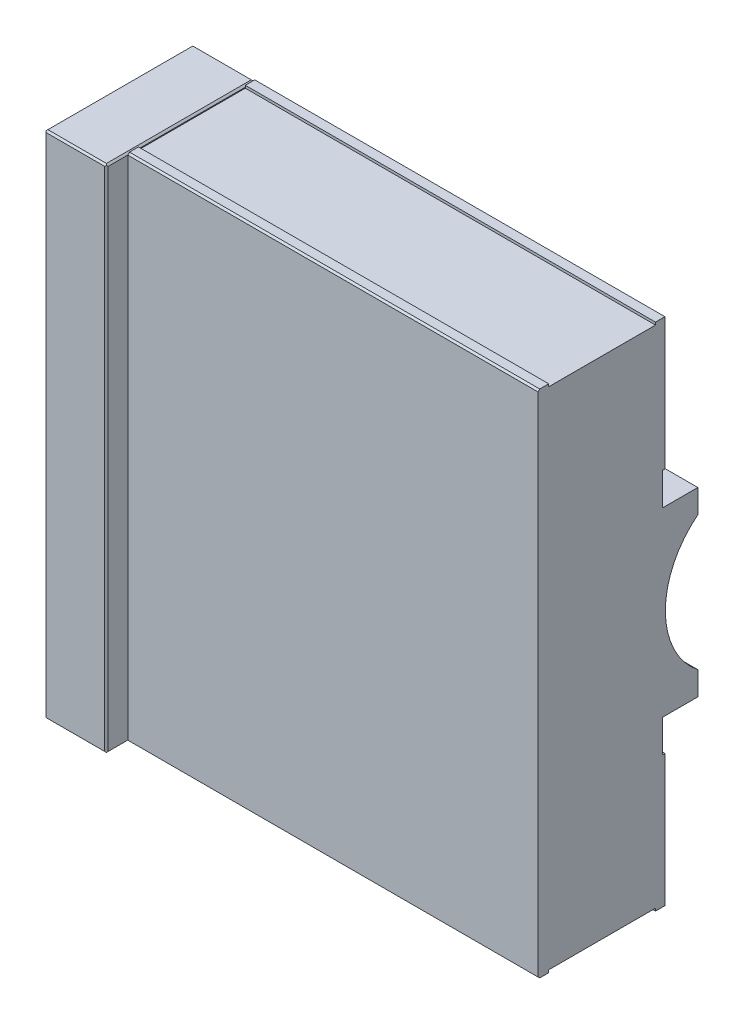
ISO-10303-21;
HEADER;
FILE_DESCRIPTION(('STEP AP214'),'2;1');
FILE_NAME('part.step','',(''),(''),'','','');
FILE_SCHEMA(('AUTOMOTIVE_DESIGN { 1 0 10303 214 1 1 1 1 }'));
ENDSEC;
DATA;
#1=APPLICATION_CONTEXT('core data for automotive mechanical design processes');
#2=APPLICATION_PROTOCOL_DEFINITION('international standard','automotive_design',2000,#1);
#3=PRODUCT_CONTEXT('',#1,'mechanical');
#4=PRODUCT('Part','Part','',(#3));
#5=PRODUCT_RELATED_PRODUCT_CATEGORY('part','',(#4));
#6=PRODUCT_DEFINITION_FORMATION('','',#4);
#7=PRODUCT_DEFINITION_CONTEXT('part definition',#1,'design');
#8=PRODUCT_DEFINITION('design','',#6,#7);
#9=PRODUCT_DEFINITION_SHAPE('','',#8);
#10=(LENGTH_UNIT() NAMED_UNIT(*) SI_UNIT(.MILLI.,.METRE.));
#11=(NAMED_UNIT(*) PLANE_ANGLE_UNIT() SI_UNIT($,.RADIAN.));
#12=(NAMED_UNIT(*) SI_UNIT($,.STERADIAN.) SOLID_ANGLE_UNIT());
#13=UNCERTAINTY_MEASURE_WITH_UNIT(LENGTH_MEASURE(1.E-05),#10,'distance_accuracy_value','');
#14=(GEOMETRIC_REPRESENTATION_CONTEXT(3) GLOBAL_UNCERTAINTY_ASSIGNED_CONTEXT((#13)) GLOBAL_UNIT_ASSIGNED_CONTEXT((#10,
#11,#12)) REPRESENTATION_CONTEXT('',''));
#15=CARTESIAN_POINT('',(0.,0.,0.));
#16=DIRECTION('',(0.,0.,1.));
#17=DIRECTION('',(1.,0.,0.));
#18=AXIS2_PLACEMENT_3D('',#15,#16,#17);
#19=CARTESIAN_POINT('',(491.246690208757,186.853667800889,0.20418309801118));
#20=DIRECTION('',(0.,-1.,0.));
#21=DIRECTION('',(0.,0.,-1.));
#22=AXIS2_PLACEMENT_3D('',#19,#20,#21);
#23=PLANE('',#22);
#24=DIRECTION('',(0.,0.,-1.));
#25=VECTOR('',#24,1.);
#26=CARTESIAN_POINT('',(491.246690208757,186.853667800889,0.20418309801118));
#27=LINE('',#26,#25);
#28=CARTESIAN_POINT('',(491.246690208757,186.853667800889,-0.557834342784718));
#29=VERTEX_POINT('',#28);
#30=CARTESIAN_POINT('',(491.246690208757,186.853667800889,0.20418309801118));
#31=VERTEX_POINT('',#30);
#32=EDGE_CURVE('P0_E361',#29,#31,#27,.F.);
#33=ORIENTED_EDGE('',*,*,#32,.T.);
#34=DIRECTION('',(-1.,0.,0.));
#35=VECTOR('',#34,1.);
#36=CARTESIAN_POINT('',(491.246690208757,186.853667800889,0.20418309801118));
#37=LINE('',#36,#35);
#38=CARTESIAN_POINT('',(369.326690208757,186.853667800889,0.20418309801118));
#39=VERTEX_POINT('',#38);
#40=EDGE_CURVE('P0_E247',#39,#31,#37,.F.);
#41=ORIENTED_EDGE('',*,*,#40,.F.);
#42=DIRECTION('',(0.,0.,-1.));
#43=VECTOR('',#42,1.);
#44=CARTESIAN_POINT('',(369.326690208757,186.853667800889,0.20418309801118));
#45=LINE('',#44,#43);
#46=CARTESIAN_POINT('',(369.326690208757,186.853667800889,-0.557834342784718));
#47=VERTEX_POINT('',#46);
#48=EDGE_CURVE('P0_E364',#39,#47,#45,.T.);
#49=ORIENTED_EDGE('',*,*,#48,.T.);
#50=DIRECTION('',(-1.,0.,0.));
#51=VECTOR('',#50,1.);
#52=CARTESIAN_POINT('',(491.246690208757,186.853667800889,-0.557834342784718));
#53=LINE('',#52,#51);
#54=EDGE_CURVE('P0_E332',#29,#47,#53,.T.);
#55=ORIENTED_EDGE('',*,*,#54,.F.);
#56=EDGE_LOOP('',(#33,#41,#49,#55));
#57=FACE_BOUND('',#56,.T.);
#58=ADVANCED_FACE('P0_F16',(#57),#23,.T.);
#59=CARTESIAN_POINT('',(491.246690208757,226.058553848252,2.23616565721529));
#60=DIRECTION('',(0.,0.,1.));
#61=DIRECTION('',(1.,0.,0.));
#62=AXIS2_PLACEMENT_3D('',#59,#60,#61);
#63=PLANE('',#62);
#64=DIRECTION('',(0.,1.,0.));
#65=VECTOR('',#64,1.);
#66=CARTESIAN_POINT('',(491.246690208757,226.058553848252,2.23616565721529));
#67=LINE('',#66,#65);
#68=CARTESIAN_POINT('',(491.246690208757,225.296553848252,2.23616565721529));
#69=VERTEX_POINT('',#68);
#70=CARTESIAN_POINT('',(491.246690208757,226.058553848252,2.23616565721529));
#71=VERTEX_POINT('',#70);
#72=EDGE_CURVE('P0_E355',#69,#71,#67,.T.);
#73=ORIENTED_EDGE('',*,*,#72,.T.);
#74=DIRECTION('',(1.,0.,0.));
#75=VECTOR('',#74,1.);
#76=CARTESIAN_POINT('',(491.246690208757,226.058553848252,2.23616565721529));
#77=LINE('',#76,#75);
#78=CARTESIAN_POINT('',(369.326690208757,226.058553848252,2.23616565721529));
#79=VERTEX_POINT('',#78);
#80=EDGE_CURVE('P0_E329',#79,#71,#77,.T.);
#81=ORIENTED_EDGE('',*,*,#80,.F.);
#82=DIRECTION('',(0.,1.,0.));
#83=VECTOR('',#82,1.);
#84=CARTESIAN_POINT('',(369.326690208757,226.058553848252,2.23616565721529));
#85=LINE('',#84,#83);
#86=CARTESIAN_POINT('',(369.326690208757,225.296553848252,2.23616565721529));
#87=VERTEX_POINT('',#86);
#88=EDGE_CURVE('P0_E358',#79,#87,#85,.F.);
#89=ORIENTED_EDGE('',*,*,#88,.T.);
#90=DIRECTION('',(1.,0.,0.));
#91=VECTOR('',#90,1.);
#92=CARTESIAN_POINT('',(491.246690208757,225.296553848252,2.23616565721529));
#93=LINE('',#92,#91);
#94=EDGE_CURVE('P0_E322',#69,#87,#93,.F.);
#95=ORIENTED_EDGE('',*,*,#94,.F.);
#96=EDGE_LOOP('',(#73,#81,#89,#95));
#97=FACE_BOUND('',#96,.T.);
#98=ADVANCED_FACE('P0_F474',(#97),#63,.T.);
#99=CARTESIAN_POINT('',(491.246690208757,74.4459612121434,33.9861656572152));
#100=DIRECTION('',(0.,0.,-1.));
#101=DIRECTION('',(-1.,0.,0.));
#102=AXIS2_PLACEMENT_3D('',#99,#100,#101);
#103=PLANE('',#102);
#104=DIRECTION('',(0.,1.,0.));
#105=VECTOR('',#104,1.);
#106=CARTESIAN_POINT('',(491.246690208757,74.4459612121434,33.9861656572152));
#107=LINE('',#106,#105);
#108=CARTESIAN_POINT('',(491.246690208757,75.2079612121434,33.9861656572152));
#109=VERTEX_POINT('',#108);
#110=CARTESIAN_POINT('',(491.246690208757,74.4459612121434,33.9861656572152));
#111=VERTEX_POINT('',#110);
#112=EDGE_CURVE('P0_E349',#109,#111,#107,.F.);
#113=ORIENTED_EDGE('',*,*,#112,.T.);
#114=DIRECTION('',(1.,0.,0.));
#115=VECTOR('',#114,1.);
#116=CARTESIAN_POINT('',(491.246690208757,74.4459612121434,33.9861656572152));
#117=LINE('',#116,#115);
#118=CARTESIAN_POINT('',(369.326690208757,74.4459612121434,33.9861656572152));
#119=VERTEX_POINT('',#118);
#120=EDGE_CURVE('P0_E317',#119,#111,#117,.T.);
#121=ORIENTED_EDGE('',*,*,#120,.F.);
#122=DIRECTION('',(0.,1.,0.));
#123=VECTOR('',#122,1.);
#124=CARTESIAN_POINT('',(369.326690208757,74.4459612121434,33.9861656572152));
#125=LINE('',#124,#123);
#126=CARTESIAN_POINT('',(369.326690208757,75.2079612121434,33.9861656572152));
#127=VERTEX_POINT('',#126);
#128=EDGE_CURVE('P0_E352',#119,#127,#125,.T.);
#129=ORIENTED_EDGE('',*,*,#128,.T.);
#130=DIRECTION('',(1.,0.,0.));
#131=VECTOR('',#130,1.);
#132=CARTESIAN_POINT('',(491.246690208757,75.2079612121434,33.9861656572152));
#133=LINE('',#132,#131);
#134=EDGE_CURVE('P0_E313',#109,#127,#133,.F.);
#135=ORIENTED_EDGE('',*,*,#134,.F.);
#136=EDGE_LOOP('',(#113,#121,#129,#135));
#137=FACE_BOUND('',#136,.T.);
#138=ADVANCED_FACE('P0_F444',(#137),#103,.T.);
#139=CARTESIAN_POINT('',(491.246690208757,75.2079612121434,2.23616565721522));
#140=DIRECTION('',(0.,0.,1.));
#141=DIRECTION('',(1.,0.,0.));
#142=AXIS2_PLACEMENT_3D('',#139,#140,#141);
#143=PLANE('',#142);
#144=DIRECTION('',(0.,1.,0.));
#145=VECTOR('',#144,1.);
#146=CARTESIAN_POINT('',(491.246690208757,75.2079612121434,2.23616565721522));
#147=LINE('',#146,#145);
#148=CARTESIAN_POINT('',(491.246690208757,74.4459612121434,2.23616565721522));
#149=VERTEX_POINT('',#148);
#150=CARTESIAN_POINT('',(491.246690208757,75.2079612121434,2.23616565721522));
#151=VERTEX_POINT('',#150);
#152=EDGE_CURVE('P0_E267',#149,#151,#147,.T.);
#153=ORIENTED_EDGE('',*,*,#152,.T.);
#154=DIRECTION('',(1.,0.,0.));
#155=VECTOR('',#154,1.);
#156=CARTESIAN_POINT('',(491.246690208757,75.2079612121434,2.23616565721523));
#157=LINE('',#156,#155);
#158=CARTESIAN_POINT('',(369.326690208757,75.2079612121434,2.23616565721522));
#159=VERTEX_POINT('',#158);
#160=EDGE_CURVE('P0_E314',#159,#151,#157,.T.);
#161=ORIENTED_EDGE('',*,*,#160,.F.);
#162=DIRECTION('',(0.,1.,0.));
#163=VECTOR('',#162,1.);
#164=CARTESIAN_POINT('',(369.326690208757,75.2079612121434,2.23616565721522));
#165=LINE('',#164,#163);
#166=CARTESIAN_POINT('',(369.326690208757,74.4459612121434,2.23616565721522));
#167=VERTEX_POINT('',#166);
#168=EDGE_CURVE('P0_E346',#159,#167,#165,.F.);
#169=ORIENTED_EDGE('',*,*,#168,.T.);
#170=DIRECTION('',(1.,0.,0.));
#171=VECTOR('',#170,1.);
#172=CARTESIAN_POINT('',(491.246690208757,74.4459612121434,2.23616565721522));
#173=LINE('',#172,#171);
#174=EDGE_CURVE('P0_E273',#149,#167,#173,.F.);
#175=ORIENTED_EDGE('',*,*,#174,.F.);
#176=EDGE_LOOP('',(#153,#161,#169,#175));
#177=FACE_BOUND('',#176,.T.);
#178=ADVANCED_FACE('P0_F488',(#177),#143,.T.);
#179=CARTESIAN_POINT('',(491.246690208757,113.650871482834,-0.557834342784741));
#180=DIRECTION('',(0.,1.,0.));
#181=DIRECTION('',(0.,0.,1.));
#182=AXIS2_PLACEMENT_3D('',#179,#180,#181);
#183=PLANE('',#182);
#184=DIRECTION('',(0.,0.,1.));
#185=VECTOR('',#184,1.);
#186=CARTESIAN_POINT('',(491.246690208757,113.650871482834,-0.557834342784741));
#187=LINE('',#186,#185);
#188=CARTESIAN_POINT('',(491.246690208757,113.650871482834,0.204183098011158));
#189=VERTEX_POINT('',#188);
#190=CARTESIAN_POINT('',(491.246690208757,113.650871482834,-0.557834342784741));
#191=VERTEX_POINT('',#190);
#192=EDGE_CURVE('P0_E260',#189,#191,#187,.F.);
#193=ORIENTED_EDGE('',*,*,#192,.T.);
#194=DIRECTION('',(-1.,0.,0.));
#195=VECTOR('',#194,1.);
#196=CARTESIAN_POINT('',(491.246690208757,113.650871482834,-0.557834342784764));
#197=LINE('',#196,#195);
#198=CARTESIAN_POINT('',(369.326690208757,113.650871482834,-0.557834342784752));
#199=VERTEX_POINT('',#198);
#200=EDGE_CURVE('P0_E270',#199,#191,#197,.F.);
#201=ORIENTED_EDGE('',*,*,#200,.F.);
#202=DIRECTION('',(0.,0.,1.));
#203=VECTOR('',#202,1.);
#204=CARTESIAN_POINT('',(369.326690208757,113.650871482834,-0.557834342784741));
#205=LINE('',#204,#203);
#206=CARTESIAN_POINT('',(369.326690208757,113.650871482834,0.204183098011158));
#207=VERTEX_POINT('',#206);
#208=EDGE_CURVE('P0_E263',#199,#207,#205,.T.);
#209=ORIENTED_EDGE('',*,*,#208,.T.);
#210=DIRECTION('',(-1.,0.,0.));
#211=VECTOR('',#210,1.);
#212=CARTESIAN_POINT('',(491.246690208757,113.650871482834,0.204183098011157));
#213=LINE('',#212,#211);
#214=EDGE_CURVE('P0_E229',#189,#207,#213,.T.);
#215=ORIENTED_EDGE('',*,*,#214,.F.);
#216=EDGE_LOOP('',(#193,#201,#209,#215));
#217=FACE_BOUND('',#216,.T.);
#218=ADVANCED_FACE('P0_F296',(#217),#183,.T.);
#219=CARTESIAN_POINT('',(491.246690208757,225.296553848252,33.9861656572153));
#220=DIRECTION('',(0.,0.,-1.));
#221=DIRECTION('',(-1.,0.,0.));
#222=AXIS2_PLACEMENT_3D('',#219,#220,#221);
#223=PLANE('',#222);
#224=DIRECTION('',(0.,1.,0.));
#225=VECTOR('',#224,1.);
#226=CARTESIAN_POINT('',(491.246690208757,225.296553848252,33.9861656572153));
#227=LINE('',#226,#225);
#228=CARTESIAN_POINT('',(491.246690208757,226.058553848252,33.9861656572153));
#229=VERTEX_POINT('',#228);
#230=CARTESIAN_POINT('',(491.246690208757,225.296553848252,33.9861656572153));
#231=VERTEX_POINT('',#230);
#232=EDGE_CURVE('P0_E248',#229,#231,#227,.F.);
#233=ORIENTED_EDGE('',*,*,#232,.T.);
#234=DIRECTION('',(1.,0.,0.));
#235=VECTOR('',#234,1.);
#236=CARTESIAN_POINT('',(491.246690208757,225.296553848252,33.9861656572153));
#237=LINE('',#236,#235);
#238=CARTESIAN_POINT('',(369.326690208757,225.296553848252,33.9861656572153));
#239=VERTEX_POINT('',#238);
#240=EDGE_CURVE('P0_E323',#239,#231,#237,.T.);
#241=ORIENTED_EDGE('',*,*,#240,.F.);
#242=DIRECTION('',(0.,1.,0.));
#243=VECTOR('',#242,1.);
#244=CARTESIAN_POINT('',(369.326690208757,225.296553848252,33.9861656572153));
#245=LINE('',#244,#243);
#246=CARTESIAN_POINT('',(369.326690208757,226.058553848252,33.9861656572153));
#247=VERTEX_POINT('',#246);
#248=EDGE_CURVE('P0_E262',#239,#247,#245,.T.);
#249=ORIENTED_EDGE('',*,*,#248,.T.);
#250=DIRECTION('',(1.,0.,0.));
#251=VECTOR('',#250,1.);
#252=CARTESIAN_POINT('',(491.246690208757,226.058553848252,33.9861656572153));
#253=LINE('',#252,#251);
#254=EDGE_CURVE('P0_E126',#229,#247,#253,.F.);
#255=ORIENTED_EDGE('',*,*,#254,.F.);
#256=EDGE_LOOP('',(#233,#241,#249,#255));
#257=FACE_BOUND('',#256,.T.);
#258=ADVANCED_FACE('P0_F479',(#257),#223,.T.);
#259=CARTESIAN_POINT('',(491.246690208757,170.181164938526,-10.3368401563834));
#260=DIRECTION('',(0.,0.,-1.));
#261=DIRECTION('',(-1.,0.,0.));
#262=AXIS2_PLACEMENT_3D('',#259,#260,#261);
#263=PLANE('',#262);
#264=DIRECTION('',(0.,1.,0.));
#265=VECTOR('',#264,1.);
#266=CARTESIAN_POINT('',(491.246690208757,150.252258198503,-10.3368401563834));
#267=LINE('',#266,#265);
#268=CARTESIAN_POINT('',(491.246690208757,170.181164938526,-10.3368401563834));
#269=VERTEX_POINT('',#268);
#270=CARTESIAN_POINT('',(491.246690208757,177.201678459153,-10.3368401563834));
#271=VERTEX_POINT('',#270);
#272=EDGE_CURVE('P0_E106',#269,#271,#267,.T.);
#273=ORIENTED_EDGE('',*,*,#272,.F.);
#274=DIRECTION('',(-1.,0.,0.));
#275=VECTOR('',#274,1.);
#276=CARTESIAN_POINT('',(491.246690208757,170.181164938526,-10.3368401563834));
#277=LINE('',#276,#275);
#278=CARTESIAN_POINT('',(369.326690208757,170.181164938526,-10.3368401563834));
#279=VERTEX_POINT('',#278);
#280=EDGE_CURVE('P0_E99',#279,#269,#277,.F.);
#281=ORIENTED_EDGE('',*,*,#280,.F.);
#282=DIRECTION('',(0.,1.,0.));
#283=VECTOR('',#282,1.);
#284=CARTESIAN_POINT('',(369.326690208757,150.252258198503,-10.3368401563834));
#285=LINE('',#284,#283);
#286=CARTESIAN_POINT('',(369.326690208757,177.201678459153,-10.3368401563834));
#287=VERTEX_POINT('',#286);
#288=EDGE_CURVE('P0_E103',#279,#287,#285,.T.);
#289=ORIENTED_EDGE('',*,*,#288,.T.);
#290=DIRECTION('',(1.,0.,0.));
#291=VECTOR('',#290,1.);
#292=CARTESIAN_POINT('',(491.246690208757,177.201678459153,-10.3368401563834));
#293=LINE('',#292,#291);
#294=EDGE_CURVE('P0_E245',#271,#287,#293,.F.);
#295=ORIENTED_EDGE('',*,*,#294,.F.);
#296=EDGE_LOOP('',(#273,#281,#289,#295));
#297=FACE_BOUND('',#296,.T.);
#298=ADVANCED_FACE('P0_F101',(#297),#263,.T.);
#299=CARTESIAN_POINT('',(491.246690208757,177.201678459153,-10.3368401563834));
#300=DIRECTION('',(0.,1.,0.));
#301=DIRECTION('',(0.,0.,1.));
#302=AXIS2_PLACEMENT_3D('',#299,#300,#301);
#303=PLANE('',#302);
#304=DIRECTION('',(0.,0.,-1.));
#305=VECTOR('',#304,1.);
#306=CARTESIAN_POINT('',(491.246690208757,177.201678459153,15.9727060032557));
#307=LINE('',#306,#305);
#308=CARTESIAN_POINT('',(491.246690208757,177.201678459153,0.204183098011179));
#309=VERTEX_POINT('',#308);
#310=EDGE_CURVE('P0_E198',#271,#309,#307,.F.);
#311=ORIENTED_EDGE('',*,*,#310,.F.);
#312=ORIENTED_EDGE('',*,*,#294,.T.);
#313=DIRECTION('',(0.,0.,-1.));
#314=VECTOR('',#313,1.);
#315=CARTESIAN_POINT('',(369.326690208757,177.201678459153,15.9727060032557));
#316=LINE('',#315,#314);
#317=CARTESIAN_POINT('',(369.326690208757,177.201678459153,0.20418309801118));
#318=VERTEX_POINT('',#317);
#319=EDGE_CURVE('P0_E120',#287,#318,#316,.F.);
#320=ORIENTED_EDGE('',*,*,#319,.T.);
#321=DIRECTION('',(-1.,0.,0.));
#322=VECTOR('',#321,1.);
#323=CARTESIAN_POINT('',(491.246690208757,177.201678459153,0.20418309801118));
#324=LINE('',#323,#322);
#325=EDGE_CURVE('P0_E337',#309,#318,#324,.T.);
#326=ORIENTED_EDGE('',*,*,#325,.F.);
#327=EDGE_LOOP('',(#311,#312,#320,#326));
#328=FACE_BOUND('',#327,.T.);
#329=ADVANCED_FACE('P0_F384',(#328),#303,.T.);
#330=CARTESIAN_POINT('',(491.246690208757,177.201678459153,0.20418309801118));
#331=DIRECTION('',(0.,0.,-1.));
#332=DIRECTION('',(-1.,0.,0.));
#333=AXIS2_PLACEMENT_3D('',#330,#331,#332);
#334=PLANE('',#333);
#335=DIRECTION('',(0.,1.,0.));
#336=VECTOR('',#335,1.);
#337=CARTESIAN_POINT('',(491.246690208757,150.252258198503,0.204183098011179));
#338=LINE('',#337,#336);
#339=EDGE_CURVE('P0_E195',#309,#31,#338,.T.);
#340=ORIENTED_EDGE('',*,*,#339,.F.);
#341=ORIENTED_EDGE('',*,*,#325,.T.);
#342=DIRECTION('',(0.,1.,0.));
#343=VECTOR('',#342,1.);
#344=CARTESIAN_POINT('',(369.326690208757,150.252258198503,0.204183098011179));
#345=LINE('',#344,#343);
#346=EDGE_CURVE('P0_E156',#318,#39,#345,.T.);
#347=ORIENTED_EDGE('',*,*,#346,.T.);
#348=ORIENTED_EDGE('',*,*,#40,.T.);
#349=EDGE_LOOP('',(#340,#341,#347,#348));
#350=FACE_BOUND('',#349,.T.);
#351=ADVANCED_FACE('P0_F379',(#350),#334,.T.);
#352=CARTESIAN_POINT('',(491.246690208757,186.853667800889,-0.557834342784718));
#353=DIRECTION('',(0.,0.,-1.));
#354=DIRECTION('',(-1.,0.,0.));
#355=AXIS2_PLACEMENT_3D('',#352,#353,#354);
#356=PLANE('',#355);
#357=DIRECTION('',(0.,1.,0.));
#358=VECTOR('',#357,1.);
#359=CARTESIAN_POINT('',(491.246690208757,150.252258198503,-0.557834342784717));
#360=LINE('',#359,#358);
#361=CARTESIAN_POINT('',(491.246690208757,226.058553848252,-0.557834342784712));
#362=VERTEX_POINT('',#361);
#363=EDGE_CURVE('P0_E192',#29,#362,#360,.T.);
#364=ORIENTED_EDGE('',*,*,#363,.F.);
#365=ORIENTED_EDGE('',*,*,#54,.T.);
#366=DIRECTION('',(0.,1.,0.));
#367=VECTOR('',#366,1.);
#368=CARTESIAN_POINT('',(369.326690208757,150.252258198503,-0.557834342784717));
#369=LINE('',#368,#367);
#370=CARTESIAN_POINT('',(369.326690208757,226.058553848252,-0.557834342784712));
#371=VERTEX_POINT('',#370);
#372=EDGE_CURVE('P0_E153',#47,#371,#369,.T.);
#373=ORIENTED_EDGE('',*,*,#372,.T.);
#374=DIRECTION('',(1.,0.,0.));
#375=VECTOR('',#374,1.);
#376=CARTESIAN_POINT('',(491.246690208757,226.058553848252,-0.557834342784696));
#377=LINE('',#376,#375);
#378=EDGE_CURVE('P0_E326',#362,#371,#377,.F.);
#379=ORIENTED_EDGE('',*,*,#378,.F.);
#380=EDGE_LOOP('',(#364,#365,#373,#379));
#381=FACE_BOUND('',#380,.T.);
#382=ADVANCED_FACE('P0_F464',(#381),#356,.T.);
#383=CARTESIAN_POINT('',(491.246690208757,226.058553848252,-0.557834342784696));
#384=DIRECTION('',(0.,1.,0.));
#385=DIRECTION('',(0.,0.,1.));
#386=AXIS2_PLACEMENT_3D('',#383,#384,#385);
#387=PLANE('',#386);
#388=DIRECTION('',(0.,0.,-1.));
#389=VECTOR('',#388,1.);
#390=CARTESIAN_POINT('',(491.246690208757,226.058553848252,15.9727060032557));
#391=LINE('',#390,#389);
#392=EDGE_CURVE('P0_E189',#362,#71,#391,.F.);
#393=ORIENTED_EDGE('',*,*,#392,.F.);
#394=ORIENTED_EDGE('',*,*,#378,.T.);
#395=DIRECTION('',(0.,0.,-1.));
#396=VECTOR('',#395,1.);
#397=CARTESIAN_POINT('',(369.326690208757,226.058553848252,15.9727060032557));
#398=LINE('',#397,#396);
#399=EDGE_CURVE('P0_E150',#371,#79,#398,.F.);
#400=ORIENTED_EDGE('',*,*,#399,.T.);
#401=ORIENTED_EDGE('',*,*,#80,.T.);
#402=EDGE_LOOP('',(#393,#394,#400,#401));
#403=FACE_BOUND('',#402,.T.);
#404=ADVANCED_FACE('P0_F470',(#403),#387,.T.);
#405=CARTESIAN_POINT('',(491.246690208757,225.296553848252,2.23616565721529));
#406=DIRECTION('',(0.,1.,0.));
#407=DIRECTION('',(0.,0.,1.));
#408=AXIS2_PLACEMENT_3D('',#405,#406,#407);
#409=PLANE('',#408);
#410=DIRECTION('',(0.,0.,-1.));
#411=VECTOR('',#410,1.);
#412=CARTESIAN_POINT('',(491.246690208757,225.296553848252,15.9727060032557));
#413=LINE('',#412,#411);
#414=EDGE_CURVE('P0_E186',#69,#231,#413,.F.);
#415=ORIENTED_EDGE('',*,*,#414,.F.);
#416=ORIENTED_EDGE('',*,*,#94,.T.);
#417=DIRECTION('',(0.,0.,-1.));
#418=VECTOR('',#417,1.);
#419=CARTESIAN_POINT('',(369.326690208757,225.296553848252,15.9727060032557));
#420=LINE('',#419,#418);
#421=EDGE_CURVE('P0_E147',#87,#239,#420,.F.);
#422=ORIENTED_EDGE('',*,*,#421,.T.);
#423=ORIENTED_EDGE('',*,*,#240,.T.);
#424=EDGE_LOOP('',(#415,#416,#422,#423));
#425=FACE_BOUND('',#424,.T.);
#426=ADVANCED_FACE('P0_F476',(#425),#409,.T.);
#427=CARTESIAN_POINT('',(491.246690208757,74.4459612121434,36.6531210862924));
#428=DIRECTION('',(0.,-1.,0.));
#429=DIRECTION('',(0.,0.,-1.));
#430=AXIS2_PLACEMENT_3D('',#427,#428,#429);
#431=PLANE('',#430);
#432=DIRECTION('',(0.,0.,-1.));
#433=VECTOR('',#432,1.);
#434=CARTESIAN_POINT('',(491.246690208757,74.4459612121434,15.9727060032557));
#435=LINE('',#434,#433);
#436=CARTESIAN_POINT('',(491.246690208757,74.4459612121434,36.6531210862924));
#437=VERTEX_POINT('',#436);
#438=EDGE_CURVE('P0_E178',#437,#111,#435,.T.);
#439=ORIENTED_EDGE('',*,*,#438,.F.);
#440=DIRECTION('',(1.,0.,0.));
#441=VECTOR('',#440,1.);
#442=CARTESIAN_POINT('',(491.246690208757,74.4459612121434,36.6531210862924));
#443=LINE('',#442,#441);
#444=CARTESIAN_POINT('',(369.326690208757,74.4459612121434,36.6531210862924));
#445=VERTEX_POINT('',#444);
#446=EDGE_CURVE('P0_E159',#445,#437,#443,.T.);
#447=ORIENTED_EDGE('',*,*,#446,.F.);
#448=DIRECTION('',(0.,0.,-1.));
#449=VECTOR('',#448,1.);
#450=CARTESIAN_POINT('',(369.326690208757,74.4459612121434,15.9727060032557));
#451=LINE('',#450,#449);
#452=EDGE_CURVE('P0_E141',#445,#119,#451,.T.);
#453=ORIENTED_EDGE('',*,*,#452,.T.);
#454=ORIENTED_EDGE('',*,*,#120,.T.);
#455=EDGE_LOOP('',(#439,#447,#453,#454));
#456=FACE_BOUND('',#455,.T.);
#457=ADVANCED_FACE('P0_F440',(#456),#431,.T.);
#458=CARTESIAN_POINT('',(491.246690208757,75.2079612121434,33.9861656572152));
#459=DIRECTION('',(0.,-1.,0.));
#460=DIRECTION('',(0.,0.,-1.));
#461=AXIS2_PLACEMENT_3D('',#458,#459,#460);
#462=PLANE('',#461);
#463=DIRECTION('',(0.,0.,-1.));
#464=VECTOR('',#463,1.);
#465=CARTESIAN_POINT('',(491.246690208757,75.2079612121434,15.9727060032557));
#466=LINE('',#465,#464);
#467=EDGE_CURVE('P0_E175',#109,#151,#466,.T.);
#468=ORIENTED_EDGE('',*,*,#467,.F.);
#469=ORIENTED_EDGE('',*,*,#134,.T.);
#470=DIRECTION('',(0.,0.,-1.));
#471=VECTOR('',#470,1.);
#472=CARTESIAN_POINT('',(369.326690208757,75.2079612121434,15.9727060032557));
#473=LINE('',#472,#471);
#474=EDGE_CURVE('P0_E138',#127,#159,#473,.T.);
#475=ORIENTED_EDGE('',*,*,#474,.T.);
#476=ORIENTED_EDGE('',*,*,#160,.T.);
#477=EDGE_LOOP('',(#468,#469,#475,#476));
#478=FACE_BOUND('',#477,.T.);
#479=ADVANCED_FACE('P0_F518',(#478),#462,.T.);
#480=CARTESIAN_POINT('',(491.246690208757,74.4459612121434,2.23616565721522));
#481=DIRECTION('',(0.,-1.,0.));
#482=DIRECTION('',(0.,0.,-1.));
#483=AXIS2_PLACEMENT_3D('',#480,#481,#482);
#484=PLANE('',#483);
#485=DIRECTION('',(0.,0.,-1.));
#486=VECTOR('',#485,1.);
#487=CARTESIAN_POINT('',(491.246690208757,74.4459612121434,15.9727060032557));
#488=LINE('',#487,#486);
#489=CARTESIAN_POINT('',(491.246690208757,74.4459612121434,-0.557834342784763));
#490=VERTEX_POINT('',#489);
#491=EDGE_CURVE('P0_E171',#149,#490,#488,.T.);
#492=ORIENTED_EDGE('',*,*,#491,.F.);
#493=ORIENTED_EDGE('',*,*,#174,.T.);
#494=DIRECTION('',(0.,0.,-1.));
#495=VECTOR('',#494,1.);
#496=CARTESIAN_POINT('',(369.326690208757,74.4459612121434,15.9727060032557));
#497=LINE('',#496,#495);
#498=CARTESIAN_POINT('',(369.326690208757,74.4459612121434,-0.557834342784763));
#499=VERTEX_POINT('',#498);
#500=EDGE_CURVE('P0_E134',#167,#499,#497,.T.);
#501=ORIENTED_EDGE('',*,*,#500,.T.);
#502=DIRECTION('',(-1.,0.,0.));
#503=VECTOR('',#502,1.);
#504=CARTESIAN_POINT('',(491.246690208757,74.4459612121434,-0.557834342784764));
#505=LINE('',#504,#503);
#506=EDGE_CURVE('P0_E238',#490,#499,#505,.T.);
#507=ORIENTED_EDGE('',*,*,#506,.F.);
#508=EDGE_LOOP('',(#492,#493,#501,#507));
#509=FACE_BOUND('',#508,.T.);
#510=ADVANCED_FACE('P0_F515',(#509),#484,.T.);
#511=CARTESIAN_POINT('',(491.246690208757,74.4459612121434,-0.557834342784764));
#512=DIRECTION('',(0.,0.,-1.));
#513=DIRECTION('',(-1.,0.,0.));
#514=AXIS2_PLACEMENT_3D('',#511,#512,#513);
#515=PLANE('',#514);
#516=DIRECTION('',(0.,1.,0.));
#517=VECTOR('',#516,1.);
#518=CARTESIAN_POINT('',(491.246690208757,150.252258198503,-0.557834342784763));
#519=LINE('',#518,#517);
#520=EDGE_CURVE('P0_E174',#490,#191,#519,.T.);
#521=ORIENTED_EDGE('',*,*,#520,.F.);
#522=ORIENTED_EDGE('',*,*,#506,.T.);
#523=DIRECTION('',(0.,1.,0.));
#524=VECTOR('',#523,1.);
#525=CARTESIAN_POINT('',(369.326690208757,150.252258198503,-0.557834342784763));
#526=LINE('',#525,#524);
#527=EDGE_CURVE('P0_E137',#499,#199,#526,.T.);
#528=ORIENTED_EDGE('',*,*,#527,.T.);
#529=ORIENTED_EDGE('',*,*,#200,.T.);
#530=EDGE_LOOP('',(#521,#522,#528,#529));
#531=FACE_BOUND('',#530,.T.);
#532=ADVANCED_FACE('P0_F306',(#531),#515,.T.);
#533=CARTESIAN_POINT('',(491.246690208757,113.650871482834,0.204183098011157));
#534=DIRECTION('',(0.,0.,-1.));
#535=DIRECTION('',(-1.,0.,0.));
#536=AXIS2_PLACEMENT_3D('',#533,#534,#535);
#537=PLANE('',#536);
#538=DIRECTION('',(0.,1.,0.));
#539=VECTOR('',#538,1.);
#540=CARTESIAN_POINT('',(491.246690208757,150.252258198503,0.204183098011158));
#541=LINE('',#540,#539);
#542=CARTESIAN_POINT('',(491.246690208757,123.30286082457,0.204183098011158));
#543=VERTEX_POINT('',#542);
#544=EDGE_CURVE('P0_E224',#189,#543,#541,.T.);
#545=ORIENTED_EDGE('',*,*,#544,.F.);
#546=ORIENTED_EDGE('',*,*,#214,.T.);
#547=DIRECTION('',(0.,1.,0.));
#548=VECTOR('',#547,1.);
#549=CARTESIAN_POINT('',(369.326690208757,150.252258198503,0.204183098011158));
#550=LINE('',#549,#548);
#551=CARTESIAN_POINT('',(369.326690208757,123.30286082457,0.204183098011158));
#552=VERTEX_POINT('',#551);
#553=EDGE_CURVE('P0_E254',#207,#552,#550,.T.);
#554=ORIENTED_EDGE('',*,*,#553,.T.);
#555=DIRECTION('',(1.,0.,0.));
#556=VECTOR('',#555,1.);
#557=CARTESIAN_POINT('',(491.246690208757,123.30286082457,0.204183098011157));
#558=LINE('',#557,#556);
#559=EDGE_CURVE('P0_E219',#543,#552,#558,.F.);
#560=ORIENTED_EDGE('',*,*,#559,.F.);
#561=EDGE_LOOP('',(#545,#546,#554,#560));
#562=FACE_BOUND('',#561,.T.);
#563=ADVANCED_FACE('P0_F293',(#562),#537,.T.);
#564=CARTESIAN_POINT('',(491.246690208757,123.30286082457,0.204183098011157));
#565=DIRECTION('',(0.,-1.,0.));
#566=DIRECTION('',(0.,0.,-1.));
#567=AXIS2_PLACEMENT_3D('',#564,#565,#566);
#568=PLANE('',#567);
#569=DIRECTION('',(0.,0.,-1.));
#570=VECTOR('',#569,1.);
#571=CARTESIAN_POINT('',(491.246690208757,123.30286082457,15.9727060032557));
#572=LINE('',#571,#570);
#573=CARTESIAN_POINT('',(491.246690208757,123.30286082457,-10.3368401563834));
#574=VERTEX_POINT('',#573);
#575=EDGE_CURVE('P0_E168',#543,#574,#572,.T.);
#576=ORIENTED_EDGE('',*,*,#575,.F.);
#577=ORIENTED_EDGE('',*,*,#559,.T.);
#578=DIRECTION('',(0.,0.,-1.));
#579=VECTOR('',#578,1.);
#580=CARTESIAN_POINT('',(369.326690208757,123.30286082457,15.9727060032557));
#581=LINE('',#580,#579);
#582=CARTESIAN_POINT('',(369.326690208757,123.30286082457,-10.3368401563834));
#583=VERTEX_POINT('',#582);
#584=EDGE_CURVE('P0_E131',#552,#583,#581,.T.);
#585=ORIENTED_EDGE('',*,*,#584,.T.);
#586=DIRECTION('',(-1.,0.,0.));
#587=VECTOR('',#586,1.);
#588=CARTESIAN_POINT('',(491.246690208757,123.30286082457,-10.3368401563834));
#589=LINE('',#588,#587);
#590=EDGE_CURVE('P0_E111',#574,#583,#589,.T.);
#591=ORIENTED_EDGE('',*,*,#590,.F.);
#592=EDGE_LOOP('',(#576,#577,#585,#591));
#593=FACE_BOUND('',#592,.T.);
#594=ADVANCED_FACE('P0_F290',(#593),#568,.T.);
#595=CARTESIAN_POINT('',(491.246690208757,123.30286082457,-10.3368401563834));
#596=DIRECTION('',(0.,0.,-1.));
#597=DIRECTION('',(-1.,0.,0.));
#598=AXIS2_PLACEMENT_3D('',#595,#596,#597);
#599=PLANE('',#598);
#600=DIRECTION('',(0.,1.,0.));
#601=VECTOR('',#600,1.);
#602=CARTESIAN_POINT('',(491.246690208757,150.252258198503,-10.3368401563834));
#603=LINE('',#602,#601);
#604=CARTESIAN_POINT('',(491.246690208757,130.323350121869,-10.3368401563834));
#605=VERTEX_POINT('',#604);
#606=EDGE_CURVE('P0_E164',#574,#605,#603,.T.);
#607=ORIENTED_EDGE('',*,*,#606,.F.);
#608=ORIENTED_EDGE('',*,*,#590,.T.);
#609=DIRECTION('',(0.,1.,0.));
#610=VECTOR('',#609,1.);
#611=CARTESIAN_POINT('',(369.326690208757,150.252258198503,-10.3368401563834));
#612=LINE('',#611,#610);
#613=CARTESIAN_POINT('',(369.326690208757,130.323350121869,-10.3368401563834));
#614=VERTEX_POINT('',#613);
#615=EDGE_CURVE('P0_E94',#583,#614,#612,.T.);
#616=ORIENTED_EDGE('',*,*,#615,.T.);
#617=DIRECTION('',(-1.,0.,0.));
#618=VECTOR('',#617,1.);
#619=CARTESIAN_POINT('',(491.246690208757,130.323350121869,-10.3368401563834));
#620=LINE('',#619,#618);
#621=EDGE_CURVE('P0_E110',#605,#614,#620,.T.);
#622=ORIENTED_EDGE('',*,*,#621,.F.);
#623=EDGE_LOOP('',(#607,#608,#616,#622));
#624=FACE_BOUND('',#623,.T.);
#625=ADVANCED_FACE('P0_F286',(#624),#599,.T.);
#626=CARTESIAN_POINT('',(491.246690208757,150.252257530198,-26.0848130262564));
#627=DIRECTION('',(-1.,0.,0.));
#628=DIRECTION('',(0.,0.,1.));
#629=AXIS2_PLACEMENT_3D('',#626,#627,#628);
#630=CYLINDRICAL_SURFACE('',#629,25.4);
#631=CARTESIAN_POINT('',(491.246690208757,150.252257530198,-26.0848130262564));
#632=DIRECTION('',(-1.,0.,0.));
#633=DIRECTION('',(0.,0.,1.));
#634=AXIS2_PLACEMENT_3D('',#631,#632,#633);
#635=CIRCLE('',#634,25.4);
#636=EDGE_CURVE('P0_E167',#605,#269,#635,.T.);
#637=ORIENTED_EDGE('',*,*,#636,.F.);
#638=ORIENTED_EDGE('',*,*,#621,.T.);
#639=CARTESIAN_POINT('',(369.326690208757,150.252257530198,-26.0848130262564));
#640=DIRECTION('',(-1.,0.,0.));
#641=DIRECTION('',(0.,0.,1.));
#642=AXIS2_PLACEMENT_3D('',#639,#640,#641);
#643=CIRCLE('',#642,25.4);
#644=EDGE_CURVE('P0_E20',#614,#279,#643,.T.);
#645=ORIENTED_EDGE('',*,*,#644,.T.);
#646=ORIENTED_EDGE('',*,*,#280,.T.);
#647=EDGE_LOOP('',(#637,#638,#645,#646));
#648=FACE_BOUND('',#647,.T.);
#649=ADVANCED_FACE('P0_F114',(#648),#630,.F.);
#650=CARTESIAN_POINT('',(491.246690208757,226.058553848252,33.9861656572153));
#651=DIRECTION('',(0.,1.,0.));
#652=DIRECTION('',(0.,0.,1.));
#653=AXIS2_PLACEMENT_3D('',#650,#651,#652);
#654=PLANE('',#653);
#655=DIRECTION('',(0.,0.,-1.));
#656=VECTOR('',#655,1.);
#657=CARTESIAN_POINT('',(491.246690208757,226.058553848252,15.9727060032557));
#658=LINE('',#657,#656);
#659=CARTESIAN_POINT('',(491.246690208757,226.058553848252,36.6531210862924));
#660=VERTEX_POINT('',#659);
#661=EDGE_CURVE('P0_E184',#229,#660,#658,.F.);
#662=ORIENTED_EDGE('',*,*,#661,.F.);
#663=ORIENTED_EDGE('',*,*,#254,.T.);
#664=DIRECTION('',(0.,0.,-1.));
#665=VECTOR('',#664,1.);
#666=CARTESIAN_POINT('',(369.326690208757,226.058553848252,15.9727060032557));
#667=LINE('',#666,#665);
#668=CARTESIAN_POINT('',(369.326690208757,226.058553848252,36.6531210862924));
#669=VERTEX_POINT('',#668);
#670=EDGE_CURVE('P0_E144',#247,#669,#667,.F.);
#671=ORIENTED_EDGE('',*,*,#670,.T.);
#672=DIRECTION('',(1.,0.,0.));
#673=VECTOR('',#672,1.);
#674=CARTESIAN_POINT('',(491.246690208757,226.058553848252,36.6531210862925));
#675=LINE('',#674,#673);
#676=EDGE_CURVE('P0_E202',#660,#669,#675,.F.);
#677=ORIENTED_EDGE('',*,*,#676,.F.);
#678=EDGE_LOOP('',(#662,#663,#671,#677));
#679=FACE_BOUND('',#678,.T.);
#680=ADVANCED_FACE('P0_F427',(#679),#654,.T.);
#681=CARTESIAN_POINT('',(369.326690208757,150.252258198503,15.9727060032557));
#682=DIRECTION('',(1.,0.,0.));
#683=DIRECTION('',(0.,0.,-1.));
#684=AXIS2_PLACEMENT_3D('',#681,#682,#683);
#685=PLANE('',#684);
#686=ORIENTED_EDGE('',*,*,#288,.F.);
#687=ORIENTED_EDGE('',*,*,#644,.F.);
#688=ORIENTED_EDGE('',*,*,#615,.F.);
#689=ORIENTED_EDGE('',*,*,#584,.F.);
#690=ORIENTED_EDGE('',*,*,#553,.F.);
#691=ORIENTED_EDGE('',*,*,#208,.F.);
#692=ORIENTED_EDGE('',*,*,#527,.F.);
#693=ORIENTED_EDGE('',*,*,#500,.F.);
#694=ORIENTED_EDGE('',*,*,#168,.F.);
#695=ORIENTED_EDGE('',*,*,#474,.F.);
#696=ORIENTED_EDGE('',*,*,#128,.F.);
#697=ORIENTED_EDGE('',*,*,#452,.F.);
#698=DIRECTION('',(0.,-0.707106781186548,-0.707106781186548));
#699=VECTOR('',#698,1.);
#700=CARTESIAN_POINT('',(369.326690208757,74.9539728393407,37.1611327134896));
#701=LINE('',#700,#699);
#702=CARTESIAN_POINT('',(369.326690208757,74.9539728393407,37.1611327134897));
#703=VERTEX_POINT('',#702);
#704=EDGE_CURVE('P0_E122',#703,#445,#701,.T.);
#705=ORIENTED_EDGE('',*,*,#704,.F.);
#706=DIRECTION('',(0.,1.,0.));
#707=VECTOR('',#706,1.);
#708=CARTESIAN_POINT('',(369.326690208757,225.550542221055,37.1611327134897));
#709=LINE('',#708,#707);
#710=CARTESIAN_POINT('',(369.326690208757,225.550542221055,37.1611327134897));
#711=VERTEX_POINT('',#710);
#712=EDGE_CURVE('P0_E205',#711,#703,#709,.F.);
#713=ORIENTED_EDGE('',*,*,#712,.F.);
#714=DIRECTION('',(0.,-0.707106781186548,0.707106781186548));
#715=VECTOR('',#714,1.);
#716=CARTESIAN_POINT('',(369.326690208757,226.058553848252,36.6531210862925));
#717=LINE('',#716,#715);
#718=EDGE_CURVE('P0_E207',#669,#711,#717,.T.);
#719=ORIENTED_EDGE('',*,*,#718,.F.);
#720=ORIENTED_EDGE('',*,*,#670,.F.);
#721=ORIENTED_EDGE('',*,*,#248,.F.);
#722=ORIENTED_EDGE('',*,*,#421,.F.);
#723=ORIENTED_EDGE('',*,*,#88,.F.);
#724=ORIENTED_EDGE('',*,*,#399,.F.);
#725=ORIENTED_EDGE('',*,*,#372,.F.);
#726=ORIENTED_EDGE('',*,*,#48,.F.);
#727=ORIENTED_EDGE('',*,*,#346,.F.);
#728=ORIENTED_EDGE('',*,*,#319,.F.);
#729=EDGE_LOOP('',(#686,#687,#688,#689,#690,#691,#692,#693,#694,#695,#696,#697,#705,#713,#719,
#720,#721,#722,#723,#724,#725,#726,#727,#728));
#730=FACE_BOUND('',#729,.T.);
#731=ADVANCED_FACE('P0_F117',(#730),#685,.F.);
#732=CARTESIAN_POINT('',(491.246690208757,74.9539728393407,37.1611327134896));
#733=DIRECTION('',(0.,-0.707106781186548,0.707106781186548));
#734=DIRECTION('',(0.,-0.707106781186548,-0.707106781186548));
#735=AXIS2_PLACEMENT_3D('',#732,#733,#734);
#736=PLANE('',#735);
#737=DIRECTION('',(0.,-0.707106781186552,-0.707106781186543));
#738=VECTOR('',#737,1.);
#739=CARTESIAN_POINT('',(491.246690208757,74.9539728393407,37.1611327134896));
#740=LINE('',#739,#738);
#741=CARTESIAN_POINT('',(491.246690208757,74.9539728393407,37.1611327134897));
#742=VERTEX_POINT('',#741);
#743=EDGE_CURVE('P0_E181',#742,#437,#740,.T.);
#744=ORIENTED_EDGE('',*,*,#743,.F.);
#745=DIRECTION('',(1.,0.,0.));
#746=VECTOR('',#745,1.);
#747=CARTESIAN_POINT('',(491.246690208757,74.9539728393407,37.1611327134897));
#748=LINE('',#747,#746);
#749=EDGE_CURVE('P0_E212',#703,#742,#748,.T.);
#750=ORIENTED_EDGE('',*,*,#749,.F.);
#751=ORIENTED_EDGE('',*,*,#704,.T.);
#752=ORIENTED_EDGE('',*,*,#446,.T.);
#753=EDGE_LOOP('',(#744,#750,#751,#752));
#754=FACE_BOUND('',#753,.T.);
#755=ADVANCED_FACE('P0_F437',(#754),#736,.T.);
#756=CARTESIAN_POINT('',(491.246690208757,150.252258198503,15.9727060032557));
#757=DIRECTION('',(1.,0.,0.));
#758=DIRECTION('',(0.,0.,-1.));
#759=AXIS2_PLACEMENT_3D('',#756,#757,#758);
#760=PLANE('',#759);
#761=ORIENTED_EDGE('',*,*,#606,.T.);
#762=ORIENTED_EDGE('',*,*,#636,.T.);
#763=ORIENTED_EDGE('',*,*,#272,.T.);
#764=ORIENTED_EDGE('',*,*,#310,.T.);
#765=ORIENTED_EDGE('',*,*,#339,.T.);
#766=ORIENTED_EDGE('',*,*,#32,.F.);
#767=ORIENTED_EDGE('',*,*,#363,.T.);
#768=ORIENTED_EDGE('',*,*,#392,.T.);
#769=ORIENTED_EDGE('',*,*,#72,.F.);
#770=ORIENTED_EDGE('',*,*,#414,.T.);
#771=ORIENTED_EDGE('',*,*,#232,.F.);
#772=ORIENTED_EDGE('',*,*,#661,.T.);
#773=DIRECTION('',(0.,-0.707106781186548,0.707106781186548));
#774=VECTOR('',#773,1.);
#775=CARTESIAN_POINT('',(491.246690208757,226.058553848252,36.6531210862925));
#776=LINE('',#775,#774);
#777=CARTESIAN_POINT('',(491.246690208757,225.550542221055,37.1611327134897));
#778=VERTEX_POINT('',#777);
#779=EDGE_CURVE('P0_E35',#778,#660,#776,.F.);
#780=ORIENTED_EDGE('',*,*,#779,.F.);
#781=DIRECTION('',(0.,1.,0.));
#782=VECTOR('',#781,1.);
#783=CARTESIAN_POINT('',(491.246690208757,225.550542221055,37.1611327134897));
#784=LINE('',#783,#782);
#785=EDGE_CURVE('P0_E26',#742,#778,#784,.T.);
#786=ORIENTED_EDGE('',*,*,#785,.F.);
#787=ORIENTED_EDGE('',*,*,#743,.T.);
#788=ORIENTED_EDGE('',*,*,#438,.T.);
#789=ORIENTED_EDGE('',*,*,#112,.F.);
#790=ORIENTED_EDGE('',*,*,#467,.T.);
#791=ORIENTED_EDGE('',*,*,#152,.F.);
#792=ORIENTED_EDGE('',*,*,#491,.T.);
#793=ORIENTED_EDGE('',*,*,#520,.T.);
#794=ORIENTED_EDGE('',*,*,#192,.F.);
#795=ORIENTED_EDGE('',*,*,#544,.T.);
#796=ORIENTED_EDGE('',*,*,#575,.T.);
#797=EDGE_LOOP('',(#761,#762,#763,#764,#765,#766,#767,#768,#769,#770,#771,#772,#780,#786,#787,
#788,#789,#790,#791,#792,#793,#794,#795,#796));
#798=FACE_BOUND('',#797,.T.);
#799=ADVANCED_FACE('P0_F283',(#798),#760,.T.);
#800=CARTESIAN_POINT('',(491.246690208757,226.058553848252,36.6531210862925));
#801=DIRECTION('',(0.,0.707106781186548,0.707106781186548));
#802=DIRECTION('',(0.,-0.707106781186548,0.707106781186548));
#803=AXIS2_PLACEMENT_3D('',#800,#801,#802);
#804=PLANE('',#803);
#805=ORIENTED_EDGE('',*,*,#779,.T.);
#806=ORIENTED_EDGE('',*,*,#676,.T.);
#807=ORIENTED_EDGE('',*,*,#718,.T.);
#808=DIRECTION('',(1.,0.,0.));
#809=VECTOR('',#808,1.);
#810=CARTESIAN_POINT('',(491.246690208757,225.550542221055,37.1611327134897));
#811=LINE('',#810,#809);
#812=EDGE_CURVE('P0_E11',#778,#711,#811,.F.);
#813=ORIENTED_EDGE('',*,*,#812,.F.);
#814=EDGE_LOOP('',(#805,#806,#807,#813));
#815=FACE_BOUND('',#814,.T.);
#816=ADVANCED_FACE('P0_F432',(#815),#804,.T.);
#817=CARTESIAN_POINT('',(491.246690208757,225.550542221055,37.1611327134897));
#818=DIRECTION('',(0.,0.,1.));
#819=DIRECTION('',(1.,0.,0.));
#820=AXIS2_PLACEMENT_3D('',#817,#818,#819);
#821=PLANE('',#820);
#822=ORIENTED_EDGE('',*,*,#785,.T.);
#823=ORIENTED_EDGE('',*,*,#812,.T.);
#824=ORIENTED_EDGE('',*,*,#712,.T.);
#825=ORIENTED_EDGE('',*,*,#749,.T.);
#826=EDGE_LOOP('',(#822,#823,#824,#825));
#827=FACE_BOUND('',#826,.T.);
#828=ADVANCED_FACE('P0_F18',(#827),#821,.T.);
#829=CLOSED_SHELL('',(#58,#98,#138,#178,#218,#258,#298,#329,#351,#382,#404,#426,#457,#479,#510,
#532,#563,#594,#625,#649,#680,#731,#755,#799,#816,#828));
#830=MANIFOLD_SOLID_BREP('P0_B1',#829);
#831=CARTESIAN_POINT('',(351.681436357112,101.054100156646,23.3181671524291));
#832=DIRECTION('',(-1.,0.,0.));
#833=DIRECTION('',(0.,0.,1.));
#834=AXIS2_PLACEMENT_3D('',#831,#832,#833);
#835=CONICAL_SURFACE('',#834,9.90599999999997,0.785398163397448);
#836=CARTESIAN_POINT('',(351.681436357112,101.054100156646,23.3181671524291));
#837=DIRECTION('',(-1.,0.,0.));
#838=DIRECTION('',(0.,-1.,0.));
#839=AXIS2_PLACEMENT_3D('',#836,#837,#838);
#840=CIRCLE('',#839,9.906);
#841=CARTESIAN_POINT('',(351.681436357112,91.1481001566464,23.3181671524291));
#842=VERTEX_POINT('',#841);
#843=EDGE_CURVE('P1_E277',#842,#842,#840,.F.);
#844=ORIENTED_EDGE('',*,*,#843,.T.);
#845=EDGE_LOOP('',(#844));
#846=FACE_BOUND('',#845,.T.);
#847=CARTESIAN_POINT('',(350.919436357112,101.054100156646,23.3181671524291));
#848=DIRECTION('',(-1.,0.,0.));
#849=DIRECTION('',(0.,0.,1.));
#850=AXIS2_PLACEMENT_3D('',#847,#848,#849);
#851=CIRCLE('',#850,10.668);
#852=CARTESIAN_POINT('',(350.919436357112,101.054100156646,33.9861671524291));
#853=VERTEX_POINT('',#852);
#854=EDGE_CURVE('P1_E20',#853,#853,#851,.T.);
#855=ORIENTED_EDGE('',*,*,#854,.T.);
#856=EDGE_LOOP('',(#855));
#857=FACE_BOUND('',#856,.T.);
#858=ADVANCED_FACE('P1_F16',(#846,#857),#835,.F.);
#859=CARTESIAN_POINT('',(351.681436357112,199.47747441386,23.3181671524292));
#860=DIRECTION('',(-1.,0.,0.));
#861=DIRECTION('',(0.,0.,1.));
#862=AXIS2_PLACEMENT_3D('',#859,#860,#861);
#863=CONICAL_SURFACE('',#862,9.90600000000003,0.785398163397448);
#864=CARTESIAN_POINT('',(350.919436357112,199.47747441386,23.3181671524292));
#865=DIRECTION('',(-1.,0.,0.));
#866=DIRECTION('',(0.,0.,1.));
#867=AXIS2_PLACEMENT_3D('',#864,#865,#866);
#868=CIRCLE('',#867,10.668);
#869=CARTESIAN_POINT('',(350.919436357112,199.47747441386,33.9861671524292));
#870=VERTEX_POINT('',#869);
#871=EDGE_CURVE('P1_E292',#870,#870,#868,.T.);
#872=ORIENTED_EDGE('',*,*,#871,.T.);
#873=EDGE_LOOP('',(#872));
#874=FACE_BOUND('',#873,.T.);
#875=CARTESIAN_POINT('',(351.681436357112,199.47747441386,23.3181671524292));
#876=DIRECTION('',(1.,0.,0.));
#877=DIRECTION('',(0.,1.,0.));
#878=AXIS2_PLACEMENT_3D('',#875,#876,#877);
#879=CIRCLE('',#878,9.906);
#880=CARTESIAN_POINT('',(351.681436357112,209.38347441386,23.3181671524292));
#881=VERTEX_POINT('',#880);
#882=EDGE_CURVE('P1_E274',#881,#881,#879,.T.);
#883=ORIENTED_EDGE('',*,*,#882,.T.);
#884=EDGE_LOOP('',(#883));
#885=FACE_BOUND('',#884,.T.);
#886=ADVANCED_FACE('P1_F580',(#874,#885),#863,.F.);
#887=CARTESIAN_POINT('',(357.650436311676,101.054100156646,23.3181671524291));
#888=DIRECTION('',(-1.,0.,0.));
#889=DIRECTION('',(0.,-1.,0.));
#890=AXIS2_PLACEMENT_3D('',#887,#888,#889);
#891=CYLINDRICAL_SURFACE('',#890,9.906);
#892=ORIENTED_EDGE('',*,*,#843,.F.);
#893=EDGE_LOOP('',(#892));
#894=FACE_BOUND('',#893,.T.);
#895=CARTESIAN_POINT('',(364.381436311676,101.054100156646,23.3181671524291));
#896=DIRECTION('',(-1.,0.,0.));
#897=DIRECTION('',(0.,-1.,0.));
#898=AXIS2_PLACEMENT_3D('',#895,#896,#897);
#899=CIRCLE('',#898,9.906);
#900=CARTESIAN_POINT('',(364.381436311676,91.1481001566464,23.3181671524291));
#901=VERTEX_POINT('',#900);
#902=EDGE_CURVE('P1_E290',#901,#901,#899,.F.);
#903=ORIENTED_EDGE('',*,*,#902,.T.);
#904=EDGE_LOOP('',(#903));
#905=FACE_BOUND('',#904,.T.);
#906=ADVANCED_FACE('P1_F312',(#894,#905),#891,.F.);
#907=CARTESIAN_POINT('',(357.650436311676,199.47747441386,23.3181671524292));
#908=DIRECTION('',(1.,0.,0.));
#909=DIRECTION('',(0.,1.,0.));
#910=AXIS2_PLACEMENT_3D('',#907,#908,#909);
#911=CYLINDRICAL_SURFACE('',#910,9.906);
#912=CARTESIAN_POINT('',(364.381436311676,199.47747441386,23.3181671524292));
#913=DIRECTION('',(1.,0.,0.));
#914=DIRECTION('',(0.,1.,0.));
#915=AXIS2_PLACEMENT_3D('',#912,#913,#914);
#916=CIRCLE('',#915,9.906);
#917=CARTESIAN_POINT('',(364.381436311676,209.38347441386,23.3181671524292));
#918=VERTEX_POINT('',#917);
#919=EDGE_CURVE('P1_E161',#918,#918,#916,.T.);
#920=ORIENTED_EDGE('',*,*,#919,.T.);
#921=EDGE_LOOP('',(#920));
#922=FACE_BOUND('',#921,.T.);
#923=ORIENTED_EDGE('',*,*,#882,.F.);
#924=EDGE_LOOP('',(#923));
#925=FACE_BOUND('',#924,.T.);
#926=ADVANCED_FACE('P1_F301',(#922,#925),#911,.F.);
#927=CARTESIAN_POINT('',(350.919436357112,74.4586804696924,43.5111629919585));
#928=DIRECTION('',(1.,0.,0.));
#929=DIRECTION('',(0.,0.,-1.));
#930=AXIS2_PLACEMENT_3D('',#927,#928,#929);
#931=PLANE('',#930);
#932=ORIENTED_EDGE('',*,*,#871,.F.);
#933=EDGE_LOOP('',(#932));
#934=FACE_BOUND('',#933,.T.);
#935=DIRECTION('',(0.,0.,1.));
#936=VECTOR('',#935,1.);
#937=CARTESIAN_POINT('',(350.919436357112,74.9682880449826,43.5111629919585));
#938=LINE('',#937,#936);
#939=CARTESIAN_POINT('',(350.919436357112,74.9682880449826,43.0031629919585));
#940=VERTEX_POINT('',#939);
#941=CARTESIAN_POINT('',(350.919436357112,74.9682880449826,-0.0498343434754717));
#942=VERTEX_POINT('',#941);
#943=EDGE_CURVE('P1_E185',#940,#942,#938,.F.);
#944=ORIENTED_EDGE('',*,*,#943,.F.);
#945=DIRECTION('',(0.,1.,0.));
#946=VECTOR('',#945,1.);
#947=CARTESIAN_POINT('',(350.919436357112,74.4586804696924,43.0031629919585));
#948=LINE('',#947,#946);
#949=CARTESIAN_POINT('',(350.919436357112,225.563286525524,43.0031629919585));
#950=VERTEX_POINT('',#949);
#951=EDGE_CURVE('P1_E157',#950,#940,#948,.F.);
#952=ORIENTED_EDGE('',*,*,#951,.F.);
#953=DIRECTION('',(0.,0.,1.));
#954=VECTOR('',#953,1.);
#955=CARTESIAN_POINT('',(350.919436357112,225.563286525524,43.5111629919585));
#956=LINE('',#955,#954);
#957=CARTESIAN_POINT('',(350.919436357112,225.563286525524,-0.0498343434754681));
#958=VERTEX_POINT('',#957);
#959=EDGE_CURVE('P1_E152',#958,#950,#956,.T.);
#960=ORIENTED_EDGE('',*,*,#959,.F.);
#961=DIRECTION('',(0.,1.,0.));
#962=VECTOR('',#961,1.);
#963=CARTESIAN_POINT('',(350.919436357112,150.264983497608,-0.0498343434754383));
#964=LINE('',#963,#962);
#965=EDGE_CURVE('P1_E141',#942,#958,#964,.T.);
#966=ORIENTED_EDGE('',*,*,#965,.F.);
#967=EDGE_LOOP('',(#944,#952,#960,#966));
#968=FACE_BOUND('',#967,.T.);
#969=ORIENTED_EDGE('',*,*,#854,.F.);
#970=EDGE_LOOP('',(#969));
#971=FACE_BOUND('',#970,.T.);
#972=ADVANCED_FACE('P1_F155',(#934,#968,#971),#931,.F.);
#973=CARTESIAN_POINT('',(364.381436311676,92.7292501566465,23.3181671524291));
#974=DIRECTION('',(1.,0.,0.));
#975=DIRECTION('',(0.,1.,0.));
#976=AXIS2_PLACEMENT_3D('',#973,#974,#975);
#977=PLANE('',#976);
#978=CARTESIAN_POINT('',(364.381436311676,101.054100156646,23.3181671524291));
#979=DIRECTION('',(-1.,0.,0.));
#980=DIRECTION('',(0.,-1.,0.));
#981=AXIS2_PLACEMENT_3D('',#978,#979,#980);
#982=CIRCLE('',#981,6.7437);
#983=CARTESIAN_POINT('',(364.381436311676,94.3104001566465,23.3181671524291));
#984=VERTEX_POINT('',#983);
#985=EDGE_CURVE('P1_E203',#984,#984,#982,.F.);
#986=ORIENTED_EDGE('',*,*,#985,.T.);
#987=EDGE_LOOP('',(#986));
#988=FACE_BOUND('',#987,.T.);
#989=ORIENTED_EDGE('',*,*,#902,.F.);
#990=EDGE_LOOP('',(#989));
#991=FACE_BOUND('',#990,.T.);
#992=ADVANCED_FACE('P1_F300',(#988,#991),#977,.F.);
#993=CARTESIAN_POINT('',(364.381436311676,207.80232441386,23.3181671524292));
#994=DIRECTION('',(1.,0.,0.));
#995=DIRECTION('',(0.,0.,-1.));
#996=AXIS2_PLACEMENT_3D('',#993,#994,#995);
#997=PLANE('',#996);
#998=CARTESIAN_POINT('',(364.381436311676,199.47747441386,23.3181671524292));
#999=DIRECTION('',(1.,0.,0.));
#1000=DIRECTION('',(0.,1.,0.));
#1001=AXIS2_PLACEMENT_3D('',#998,#999,#1000);
#1002=CIRCLE('',#1001,6.7437);
#1003=CARTESIAN_POINT('',(364.381436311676,206.22117441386,23.3181671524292));
#1004=VERTEX_POINT('',#1003);
#1005=EDGE_CURVE('P1_E218',#1004,#1004,#1002,.T.);
#1006=ORIENTED_EDGE('',*,*,#1005,.T.);
#1007=EDGE_LOOP('',(#1006));
#1008=FACE_BOUND('',#1007,.T.);
#1009=ORIENTED_EDGE('',*,*,#919,.F.);
#1010=EDGE_LOOP('',(#1009));
#1011=FACE_BOUND('',#1010,.T.);
#1012=ADVANCED_FACE('P1_F309',(#1008,#1011),#997,.F.);
#1013=CARTESIAN_POINT('',(351.173436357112,225.817286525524,43.5111629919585));
#1014=DIRECTION('',(-0.707106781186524,0.707106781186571,0.));
#1015=DIRECTION('',(-0.707106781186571,-0.707106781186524,0.));
#1016=AXIS2_PLACEMENT_3D('',#1013,#1014,#1015);
#1017=PLANE('',#1016);
#1018=DIRECTION('',(-0.577350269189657,-0.577350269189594,0.577350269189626));
#1019=VECTOR('',#1018,1.);
#1020=CARTESIAN_POINT('',(351.427436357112,226.071286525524,43.0031629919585));
#1021=LINE('',#1020,#1019);
#1022=CARTESIAN_POINT('',(351.427436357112,226.071286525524,43.0031629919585));
#1023=VERTEX_POINT('',#1022);
#1024=CARTESIAN_POINT('',(351.173436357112,225.817286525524,43.2571629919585));
#1025=VERTEX_POINT('',#1024);
#1026=EDGE_CURVE('P1_E206',#1023,#1025,#1021,.T.);
#1027=ORIENTED_EDGE('',*,*,#1026,.F.);
#1028=DIRECTION('',(0.,0.,1.));
#1029=VECTOR('',#1028,1.);
#1030=CARTESIAN_POINT('',(351.427436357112,226.071286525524,43.5111629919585));
#1031=LINE('',#1030,#1029);
#1032=CARTESIAN_POINT('',(351.427436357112,226.071286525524,-0.0498343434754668));
#1033=VERTEX_POINT('',#1032);
#1034=EDGE_CURVE('P1_E213',#1033,#1023,#1031,.T.);
#1035=ORIENTED_EDGE('',*,*,#1034,.F.);
#1036=DIRECTION('',(0.577350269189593,0.577350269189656,0.577350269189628));
#1037=VECTOR('',#1036,1.);
#1038=CARTESIAN_POINT('',(351.173436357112,225.817286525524,-0.303834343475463));
#1039=LINE('',#1038,#1037);
#1040=CARTESIAN_POINT('',(351.173436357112,225.817286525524,-0.303834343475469));
#1041=VERTEX_POINT('',#1040);
#1042=EDGE_CURVE('P1_E167',#1041,#1033,#1039,.T.);
#1043=ORIENTED_EDGE('',*,*,#1042,.F.);
#1044=DIRECTION('',(0.577350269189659,0.577350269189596,-0.577350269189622));
#1045=VECTOR('',#1044,1.);
#1046=CARTESIAN_POINT('',(350.919436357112,225.563286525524,-0.0498343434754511));
#1047=LINE('',#1046,#1045);
#1048=EDGE_CURVE('P1_E146',#958,#1041,#1047,.T.);
#1049=ORIENTED_EDGE('',*,*,#1048,.F.);
#1050=ORIENTED_EDGE('',*,*,#959,.T.);
#1051=DIRECTION('',(-0.577350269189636,-0.577350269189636,-0.577350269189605));
#1052=VECTOR('',#1051,1.);
#1053=CARTESIAN_POINT('',(351.173436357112,225.817286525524,43.2571629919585));
#1054=LINE('',#1053,#1052);
#1055=EDGE_CURVE('P1_E188',#1025,#950,#1054,.T.);
#1056=ORIENTED_EDGE('',*,*,#1055,.F.);
#1057=EDGE_LOOP('',(#1027,#1035,#1043,#1049,#1050,#1056));
#1058=FACE_BOUND('',#1057,.T.);
#1059=ADVANCED_FACE('P1_F165',(#1058),#1017,.T.);
#1060=CARTESIAN_POINT('',(351.173436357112,150.264983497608,-0.303834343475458));
#1061=DIRECTION('',(-0.707106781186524,0.,-0.707106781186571));
#1062=DIRECTION('',(-0.707106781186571,0.,0.707106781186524));
#1063=AXIS2_PLACEMENT_3D('',#1060,#1061,#1062);
#1064=PLANE('',#1063);
#1065=ORIENTED_EDGE('',*,*,#1048,.T.);
#1066=DIRECTION('',(-0.577350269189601,0.577350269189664,0.577350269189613));
#1067=VECTOR('',#1066,1.);
#1068=CARTESIAN_POINT('',(351.427436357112,225.563286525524,-0.557834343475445));
#1069=LINE('',#1068,#1067);
#1070=CARTESIAN_POINT('',(351.427436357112,225.563286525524,-0.557834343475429));
#1071=VERTEX_POINT('',#1070);
#1072=EDGE_CURVE('P1_E168',#1071,#1041,#1069,.T.);
#1073=ORIENTED_EDGE('',*,*,#1072,.F.);
#1074=DIRECTION('',(0.,1.,0.));
#1075=VECTOR('',#1074,1.);
#1076=CARTESIAN_POINT('',(351.427436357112,226.071286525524,-0.557834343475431));
#1077=LINE('',#1076,#1075);
#1078=CARTESIAN_POINT('',(351.427436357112,74.9682880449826,-0.55783434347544));
#1079=VERTEX_POINT('',#1078);
#1080=EDGE_CURVE('P1_E223',#1079,#1071,#1077,.T.);
#1081=ORIENTED_EDGE('',*,*,#1080,.F.);
#1082=DIRECTION('',(0.577350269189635,0.577350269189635,-0.577350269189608));
#1083=VECTOR('',#1082,1.);
#1084=CARTESIAN_POINT('',(351.173436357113,74.7142880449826,-0.303834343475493));
#1085=LINE('',#1084,#1083);
#1086=CARTESIAN_POINT('',(351.173436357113,74.7142880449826,-0.303834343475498));
#1087=VERTEX_POINT('',#1086);
#1088=EDGE_CURVE('P1_E178',#1087,#1079,#1085,.T.);
#1089=ORIENTED_EDGE('',*,*,#1088,.F.);
#1090=DIRECTION('',(0.577350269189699,-0.577350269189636,-0.577350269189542));
#1091=VECTOR('',#1090,1.);
#1092=CARTESIAN_POINT('',(350.919436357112,74.9682880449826,-0.0498343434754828));
#1093=LINE('',#1092,#1091);
#1094=EDGE_CURVE('P1_E149',#942,#1087,#1093,.T.);
#1095=ORIENTED_EDGE('',*,*,#1094,.F.);
#1096=ORIENTED_EDGE('',*,*,#965,.T.);
#1097=EDGE_LOOP('',(#1065,#1073,#1081,#1089,#1095,#1096));
#1098=FACE_BOUND('',#1097,.T.);
#1099=ADVANCED_FACE('P1_F143',(#1098),#1064,.T.);
#1100=CARTESIAN_POINT('',(369.334436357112,225.817286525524,-0.303834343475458));
#1101=DIRECTION('',(0.,0.707106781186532,-0.707106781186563));
#1102=DIRECTION('',(0.,0.707106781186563,0.707106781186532));
#1103=AXIS2_PLACEMENT_3D('',#1100,#1101,#1102);
#1104=PLANE('',#1103);
#1105=DIRECTION('',(0.577350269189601,-0.577350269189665,-0.577350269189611));
#1106=VECTOR('',#1105,1.);
#1107=CARTESIAN_POINT('',(368.826436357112,226.071286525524,-0.0498343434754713));
#1108=LINE('',#1107,#1106);
#1109=CARTESIAN_POINT('',(368.826436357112,226.071286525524,-0.0498343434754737));
#1110=VERTEX_POINT('',#1109);
#1111=CARTESIAN_POINT('',(369.080436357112,225.817286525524,-0.303834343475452));
#1112=VERTEX_POINT('',#1111);
#1113=EDGE_CURVE('P1_E175',#1110,#1112,#1108,.T.);
#1114=ORIENTED_EDGE('',*,*,#1113,.T.);
#1115=DIRECTION('',(-0.577350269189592,-0.577350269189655,-0.57735026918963));
#1116=VECTOR('',#1115,1.);
#1117=CARTESIAN_POINT('',(369.080436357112,225.817286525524,-0.303834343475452));
#1118=LINE('',#1117,#1116);
#1119=CARTESIAN_POINT('',(368.826436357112,225.563286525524,-0.557834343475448));
#1120=VERTEX_POINT('',#1119);
#1121=EDGE_CURVE('P1_E172',#1112,#1120,#1118,.T.);
#1122=ORIENTED_EDGE('',*,*,#1121,.T.);
#1123=DIRECTION('',(-1.,0.,0.));
#1124=VECTOR('',#1123,1.);
#1125=CARTESIAN_POINT('',(369.334436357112,225.563286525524,-0.55783434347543));
#1126=LINE('',#1125,#1124);
#1127=EDGE_CURVE('P1_E219',#1071,#1120,#1126,.F.);
#1128=ORIENTED_EDGE('',*,*,#1127,.F.);
#1129=ORIENTED_EDGE('',*,*,#1072,.T.);
#1130=ORIENTED_EDGE('',*,*,#1042,.T.);
#1131=DIRECTION('',(1.,0.,0.));
#1132=VECTOR('',#1131,1.);
#1133=CARTESIAN_POINT('',(369.334436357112,226.071286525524,-0.049834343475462));
#1134=LINE('',#1133,#1132);
#1135=EDGE_CURVE('P1_E215',#1110,#1033,#1134,.F.);
#1136=ORIENTED_EDGE('',*,*,#1135,.F.);
#1137=EDGE_LOOP('',(#1114,#1122,#1128,#1129,#1130,#1136));
#1138=FACE_BOUND('',#1137,.T.);
#1139=ADVANCED_FACE('P1_F395',(#1138),#1104,.T.);
#1140=CARTESIAN_POINT('',(369.334436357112,74.7142880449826,-0.30383434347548));
#1141=DIRECTION('',(0.,-0.707106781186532,-0.707106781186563));
#1142=DIRECTION('',(0.,0.707106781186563,-0.707106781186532));
#1143=AXIS2_PLACEMENT_3D('',#1140,#1141,#1142);
#1144=PLANE('',#1143);
#1145=DIRECTION('',(0.577350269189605,-0.577350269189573,0.577350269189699));
#1146=VECTOR('',#1145,1.);
#1147=CARTESIAN_POINT('',(351.173436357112,74.7142880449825,-0.303834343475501));
#1148=LINE('',#1147,#1146);
#1149=CARTESIAN_POINT('',(351.427436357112,74.4602880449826,-0.0498343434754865));
#1150=VERTEX_POINT('',#1149);
#1151=EDGE_CURVE('P1_E180',#1087,#1150,#1148,.T.);
#1152=ORIENTED_EDGE('',*,*,#1151,.F.);
#1153=ORIENTED_EDGE('',*,*,#1088,.T.);
#1154=DIRECTION('',(-1.,0.,0.));
#1155=VECTOR('',#1154,1.);
#1156=CARTESIAN_POINT('',(369.334436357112,74.9682880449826,-0.55783434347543));
#1157=LINE('',#1156,#1155);
#1158=CARTESIAN_POINT('',(368.826436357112,74.9682880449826,-0.557834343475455));
#1159=VERTEX_POINT('',#1158);
#1160=EDGE_CURVE('P1_E212',#1159,#1079,#1157,.T.);
#1161=ORIENTED_EDGE('',*,*,#1160,.F.);
#1162=DIRECTION('',(0.577350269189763,-0.577350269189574,0.577350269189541));
#1163=VECTOR('',#1162,1.);
#1164=CARTESIAN_POINT('',(368.826436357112,74.9682880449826,-0.557834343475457));
#1165=LINE('',#1164,#1163);
#1166=CARTESIAN_POINT('',(369.080436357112,74.7142880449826,-0.303834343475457));
#1167=VERTEX_POINT('',#1166);
#1168=EDGE_CURVE('P1_E174',#1159,#1167,#1165,.T.);
#1169=ORIENTED_EDGE('',*,*,#1168,.T.);
#1170=DIRECTION('',(-0.577350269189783,-0.577350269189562,0.577350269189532));
#1171=VECTOR('',#1170,1.);
#1172=CARTESIAN_POINT('',(369.080436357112,74.7142880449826,-0.303834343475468));
#1173=LINE('',#1172,#1171);
#1174=CARTESIAN_POINT('',(368.826436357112,74.4602880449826,-0.0498343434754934));
#1175=VERTEX_POINT('',#1174);
#1176=EDGE_CURVE('P1_E181',#1167,#1175,#1173,.T.);
#1177=ORIENTED_EDGE('',*,*,#1176,.T.);
#1178=DIRECTION('',(1.,0.,0.));
#1179=VECTOR('',#1178,1.);
#1180=CARTESIAN_POINT('',(369.334436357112,74.4602880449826,-0.0498343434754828));
#1181=LINE('',#1180,#1179);
#1182=EDGE_CURVE('P1_E222',#1150,#1175,#1181,.T.);
#1183=ORIENTED_EDGE('',*,*,#1182,.F.);
#1184=EDGE_LOOP('',(#1152,#1153,#1161,#1169,#1177,#1183));
#1185=FACE_BOUND('',#1184,.T.);
#1186=ADVANCED_FACE('P1_F366',(#1185),#1144,.T.);
#1187=CARTESIAN_POINT('',(351.173436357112,74.7142880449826,43.5111629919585));
#1188=DIRECTION('',(-0.707106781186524,-0.707106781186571,0.));
#1189=DIRECTION('',(0.707106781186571,-0.707106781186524,0.));
#1190=AXIS2_PLACEMENT_3D('',#1187,#1188,#1189);
#1191=PLANE('',#1190);
#1192=ORIENTED_EDGE('',*,*,#943,.T.);
#1193=ORIENTED_EDGE('',*,*,#1094,.T.);
#1194=ORIENTED_EDGE('',*,*,#1151,.T.);
#1195=DIRECTION('',(0.,0.,1.));
#1196=VECTOR('',#1195,1.);
#1197=CARTESIAN_POINT('',(351.427436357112,74.4602880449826,43.5111629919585));
#1198=LINE('',#1197,#1196);
#1199=CARTESIAN_POINT('',(351.427436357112,74.4602880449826,43.0031629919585));
#1200=VERTEX_POINT('',#1199);
#1201=EDGE_CURVE('P1_E227',#1200,#1150,#1198,.F.);
#1202=ORIENTED_EDGE('',*,*,#1201,.F.);
#1203=DIRECTION('',(0.577350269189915,-0.577350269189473,-0.577350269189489));
#1204=VECTOR('',#1203,1.);
#1205=CARTESIAN_POINT('',(351.173436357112,74.7142880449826,43.2571629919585));
#1206=LINE('',#1205,#1204);
#1207=CARTESIAN_POINT('',(351.173436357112,74.7142880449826,43.2571629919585));
#1208=VERTEX_POINT('',#1207);
#1209=EDGE_CURVE('P1_E194',#1208,#1200,#1206,.T.);
#1210=ORIENTED_EDGE('',*,*,#1209,.F.);
#1211=DIRECTION('',(0.577350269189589,-0.577350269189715,0.577350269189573));
#1212=VECTOR('',#1211,1.);
#1213=CARTESIAN_POINT('',(350.919436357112,74.9682880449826,43.0031629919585));
#1214=LINE('',#1213,#1212);
#1215=EDGE_CURVE('P1_E191',#940,#1208,#1214,.T.);
#1216=ORIENTED_EDGE('',*,*,#1215,.F.);
#1217=EDGE_LOOP('',(#1192,#1193,#1194,#1202,#1210,#1216));
#1218=FACE_BOUND('',#1217,.T.);
#1219=ADVANCED_FACE('P1_F387',(#1218),#1191,.T.);
#1220=CARTESIAN_POINT('',(351.173436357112,74.4586804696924,43.2571629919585));
#1221=DIRECTION('',(-0.70710678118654,0.,0.707106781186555));
#1222=DIRECTION('',(0.707106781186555,0.,0.70710678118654));
#1223=AXIS2_PLACEMENT_3D('',#1220,#1221,#1222);
#1224=PLANE('',#1223);
#1225=DIRECTION('',(0.577350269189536,-0.577350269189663,0.577350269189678));
#1226=VECTOR('',#1225,1.);
#1227=CARTESIAN_POINT('',(351.173436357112,225.817286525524,43.2571629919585));
#1228=LINE('',#1227,#1226);
#1229=CARTESIAN_POINT('',(351.427436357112,225.563286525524,43.5111629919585));
#1230=VERTEX_POINT('',#1229);
#1231=EDGE_CURVE('P1_E204',#1025,#1230,#1228,.T.);
#1232=ORIENTED_EDGE('',*,*,#1231,.F.);
#1233=ORIENTED_EDGE('',*,*,#1055,.T.);
#1234=ORIENTED_EDGE('',*,*,#951,.T.);
#1235=ORIENTED_EDGE('',*,*,#1215,.T.);
#1236=DIRECTION('',(-0.577350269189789,-0.577350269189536,-0.577350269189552));
#1237=VECTOR('',#1236,1.);
#1238=CARTESIAN_POINT('',(351.427436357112,74.9682880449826,43.5111629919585));
#1239=LINE('',#1238,#1237);
#1240=CARTESIAN_POINT('',(351.427436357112,74.9682880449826,43.5111629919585));
#1241=VERTEX_POINT('',#1240);
#1242=EDGE_CURVE('P1_E197',#1241,#1208,#1239,.T.);
#1243=ORIENTED_EDGE('',*,*,#1242,.F.);
#1244=DIRECTION('',(0.,-1.,0.));
#1245=VECTOR('',#1244,1.);
#1246=CARTESIAN_POINT('',(351.427436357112,74.4586804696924,43.5111629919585));
#1247=LINE('',#1246,#1245);
#1248=EDGE_CURVE('P1_E230',#1230,#1241,#1247,.T.);
#1249=ORIENTED_EDGE('',*,*,#1248,.F.);
#1250=EDGE_LOOP('',(#1232,#1233,#1234,#1235,#1243,#1249));
#1251=FACE_BOUND('',#1250,.T.);
#1252=ADVANCED_FACE('P1_F384',(#1251),#1224,.T.);
#1253=CARTESIAN_POINT('',(369.334436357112,74.7142880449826,43.2571629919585));
#1254=DIRECTION('',(0.,-0.707106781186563,0.707106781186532));
#1255=DIRECTION('',(0.,-0.707106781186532,-0.707106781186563));
#1256=AXIS2_PLACEMENT_3D('',#1253,#1254,#1255);
#1257=PLANE('',#1256);
#1258=ORIENTED_EDGE('',*,*,#1209,.T.);
#1259=DIRECTION('',(1.,0.,0.));
#1260=VECTOR('',#1259,1.);
#1261=CARTESIAN_POINT('',(369.334436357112,74.4602880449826,43.0031629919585));
#1262=LINE('',#1261,#1260);
#1263=CARTESIAN_POINT('',(368.826436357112,74.4602880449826,43.0031629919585));
#1264=VERTEX_POINT('',#1263);
#1265=EDGE_CURVE('P1_E231',#1264,#1200,#1262,.F.);
#1266=ORIENTED_EDGE('',*,*,#1265,.F.);
#1267=DIRECTION('',(0.577350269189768,0.577350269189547,0.577350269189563));
#1268=VECTOR('',#1267,1.);
#1269=CARTESIAN_POINT('',(368.826436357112,74.4602880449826,43.0031629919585));
#1270=LINE('',#1269,#1268);
#1271=CARTESIAN_POINT('',(369.080436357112,74.7142880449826,43.2571629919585));
#1272=VERTEX_POINT('',#1271);
#1273=EDGE_CURVE('P1_E190',#1264,#1272,#1270,.T.);
#1274=ORIENTED_EDGE('',*,*,#1273,.T.);
#1275=DIRECTION('',(-0.577350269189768,0.577350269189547,0.577350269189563));
#1276=VECTOR('',#1275,1.);
#1277=CARTESIAN_POINT('',(369.080436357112,74.7142880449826,43.2571629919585));
#1278=LINE('',#1277,#1276);
#1279=CARTESIAN_POINT('',(368.826436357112,74.9682880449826,43.5111629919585));
#1280=VERTEX_POINT('',#1279);
#1281=EDGE_CURVE('P1_E54',#1272,#1280,#1278,.T.);
#1282=ORIENTED_EDGE('',*,*,#1281,.T.);
#1283=DIRECTION('',(1.,0.,0.));
#1284=VECTOR('',#1283,1.);
#1285=CARTESIAN_POINT('',(369.334436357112,74.9682880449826,43.5111629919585));
#1286=LINE('',#1285,#1284);
#1287=EDGE_CURVE('P1_E240',#1241,#1280,#1286,.T.);
#1288=ORIENTED_EDGE('',*,*,#1287,.F.);
#1289=ORIENTED_EDGE('',*,*,#1242,.T.);
#1290=EDGE_LOOP('',(#1258,#1266,#1274,#1282,#1288,#1289));
#1291=FACE_BOUND('',#1290,.T.);
#1292=ADVANCED_FACE('P1_F359',(#1291),#1257,.T.);
#1293=CARTESIAN_POINT('',(369.334436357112,225.817286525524,43.2571629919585));
#1294=DIRECTION('',(0.,0.707106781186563,0.707106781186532));
#1295=DIRECTION('',(0.,-0.707106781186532,0.707106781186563));
#1296=AXIS2_PLACEMENT_3D('',#1293,#1294,#1295);
#1297=PLANE('',#1296);
#1298=DIRECTION('',(1.,0.,0.));
#1299=VECTOR('',#1298,1.);
#1300=CARTESIAN_POINT('',(369.334436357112,225.563286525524,43.5111629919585));
#1301=LINE('',#1300,#1299);
#1302=CARTESIAN_POINT('',(368.826436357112,225.563286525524,43.5111629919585));
#1303=VERTEX_POINT('',#1302);
#1304=EDGE_CURVE('P1_E236',#1303,#1230,#1301,.F.);
#1305=ORIENTED_EDGE('',*,*,#1304,.F.);
#1306=DIRECTION('',(0.577350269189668,0.577350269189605,-0.577350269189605));
#1307=VECTOR('',#1306,1.);
#1308=CARTESIAN_POINT('',(368.826436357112,225.563286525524,43.5111629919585));
#1309=LINE('',#1308,#1307);
#1310=CARTESIAN_POINT('',(369.080436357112,225.817286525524,43.2571629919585));
#1311=VERTEX_POINT('',#1310);
#1312=EDGE_CURVE('P1_E61',#1303,#1311,#1309,.T.);
#1313=ORIENTED_EDGE('',*,*,#1312,.T.);
#1314=DIRECTION('',(-0.577350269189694,0.577350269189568,-0.577350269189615));
#1315=VECTOR('',#1314,1.);
#1316=CARTESIAN_POINT('',(369.080436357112,225.817286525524,43.2571629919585));
#1317=LINE('',#1316,#1315);
#1318=CARTESIAN_POINT('',(368.826436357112,226.071286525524,43.0031629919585));
#1319=VERTEX_POINT('',#1318);
#1320=EDGE_CURVE('P1_E196',#1311,#1319,#1317,.T.);
#1321=ORIENTED_EDGE('',*,*,#1320,.T.);
#1322=DIRECTION('',(1.,0.,0.));
#1323=VECTOR('',#1322,1.);
#1324=CARTESIAN_POINT('',(369.334436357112,226.071286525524,43.0031629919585));
#1325=LINE('',#1324,#1323);
#1326=EDGE_CURVE('P1_E209',#1023,#1319,#1325,.T.);
#1327=ORIENTED_EDGE('',*,*,#1326,.F.);
#1328=ORIENTED_EDGE('',*,*,#1026,.T.);
#1329=ORIENTED_EDGE('',*,*,#1231,.T.);
#1330=EDGE_LOOP('',(#1305,#1313,#1321,#1327,#1328,#1329));
#1331=FACE_BOUND('',#1330,.T.);
#1332=ADVANCED_FACE('P1_F375',(#1331),#1297,.T.);
#1333=CARTESIAN_POINT('',(366.857936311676,101.054100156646,23.3181671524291));
#1334=DIRECTION('',(-1.,0.,0.));
#1335=DIRECTION('',(0.,-1.,0.));
#1336=AXIS2_PLACEMENT_3D('',#1333,#1334,#1335);
#1337=CYLINDRICAL_SURFACE('',#1336,6.7437);
#1338=CARTESIAN_POINT('',(368.572436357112,101.054100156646,23.3181671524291));
#1339=DIRECTION('',(1.,0.,0.));
#1340=DIRECTION('',(0.,1.,0.));
#1341=AXIS2_PLACEMENT_3D('',#1338,#1339,#1340);
#1342=CIRCLE('',#1341,6.74369999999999);
#1343=CARTESIAN_POINT('',(368.572436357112,107.797800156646,23.3181671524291));
#1344=VERTEX_POINT('',#1343);
#1345=EDGE_CURVE('P1_E239',#1344,#1344,#1342,.F.);
#1346=ORIENTED_EDGE('',*,*,#1345,.F.);
#1347=EDGE_LOOP('',(#1346));
#1348=FACE_BOUND('',#1347,.T.);
#1349=ORIENTED_EDGE('',*,*,#985,.F.);
#1350=EDGE_LOOP('',(#1349));
#1351=FACE_BOUND('',#1350,.T.);
#1352=ADVANCED_FACE('P1_F403',(#1348,#1351),#1337,.F.);
#1353=CARTESIAN_POINT('',(366.857936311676,199.47747441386,23.3181671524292));
#1354=DIRECTION('',(1.,0.,0.));
#1355=DIRECTION('',(0.,1.,0.));
#1356=AXIS2_PLACEMENT_3D('',#1353,#1354,#1355);
#1357=CYLINDRICAL_SURFACE('',#1356,6.7437);
#1358=ORIENTED_EDGE('',*,*,#1005,.F.);
#1359=EDGE_LOOP('',(#1358));
#1360=FACE_BOUND('',#1359,.T.);
#1361=CARTESIAN_POINT('',(368.572436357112,199.47747441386,23.3181671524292));
#1362=DIRECTION('',(1.,0.,0.));
#1363=DIRECTION('',(0.,-1.,0.));
#1364=AXIS2_PLACEMENT_3D('',#1361,#1362,#1363);
#1365=CIRCLE('',#1364,6.74370000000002);
#1366=CARTESIAN_POINT('',(368.572436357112,192.73377441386,23.3181671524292));
#1367=VERTEX_POINT('',#1366);
#1368=EDGE_CURVE('P1_E247',#1367,#1367,#1365,.F.);
#1369=ORIENTED_EDGE('',*,*,#1368,.F.);
#1370=EDGE_LOOP('',(#1369));
#1371=FACE_BOUND('',#1370,.T.);
#1372=ADVANCED_FACE('P1_F406',(#1360,#1371),#1357,.F.);
#1373=CARTESIAN_POINT('',(369.334436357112,226.071286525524,43.5111629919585));
#1374=DIRECTION('',(0.,1.,0.));
#1375=DIRECTION('',(0.,0.,1.));
#1376=AXIS2_PLACEMENT_3D('',#1373,#1374,#1375);
#1377=PLANE('',#1376);
#1378=ORIENTED_EDGE('',*,*,#1326,.T.);
#1379=DIRECTION('',(0.,0.,1.));
#1380=VECTOR('',#1379,1.);
#1381=CARTESIAN_POINT('',(368.826436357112,226.071286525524,32.4939136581));
#1382=LINE('',#1381,#1380);
#1383=EDGE_CURVE('P1_E243',#1110,#1319,#1382,.T.);
#1384=ORIENTED_EDGE('',*,*,#1383,.F.);
#1385=ORIENTED_EDGE('',*,*,#1135,.T.);
#1386=ORIENTED_EDGE('',*,*,#1034,.T.);
#1387=EDGE_LOOP('',(#1378,#1384,#1385,#1386));
#1388=FACE_BOUND('',#1387,.T.);
#1389=ADVANCED_FACE('P1_F377',(#1388),#1377,.T.);
#1390=CARTESIAN_POINT('',(369.334436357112,226.071286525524,-0.55783434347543));
#1391=DIRECTION('',(0.,0.,-1.));
#1392=DIRECTION('',(-1.,0.,0.));
#1393=AXIS2_PLACEMENT_3D('',#1390,#1391,#1392);
#1394=PLANE('',#1393);
#1395=ORIENTED_EDGE('',*,*,#1080,.T.);
#1396=ORIENTED_EDGE('',*,*,#1127,.T.);
#1397=DIRECTION('',(0.,1.,0.));
#1398=VECTOR('',#1397,1.);
#1399=CARTESIAN_POINT('',(368.826436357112,188.168135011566,-0.55783434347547));
#1400=LINE('',#1399,#1398);
#1401=EDGE_CURVE('P1_E246',#1159,#1120,#1400,.T.);
#1402=ORIENTED_EDGE('',*,*,#1401,.F.);
#1403=ORIENTED_EDGE('',*,*,#1160,.T.);
#1404=EDGE_LOOP('',(#1395,#1396,#1402,#1403));
#1405=FACE_BOUND('',#1404,.T.);
#1406=ADVANCED_FACE('P1_F413',(#1405),#1394,.T.);
#1407=CARTESIAN_POINT('',(369.334436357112,74.4602880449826,43.5111629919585));
#1408=DIRECTION('',(0.,-1.,0.));
#1409=DIRECTION('',(1.,0.,0.));
#1410=AXIS2_PLACEMENT_3D('',#1407,#1408,#1409);
#1411=PLANE('',#1410);
#1412=ORIENTED_EDGE('',*,*,#1265,.T.);
#1413=ORIENTED_EDGE('',*,*,#1201,.T.);
#1414=ORIENTED_EDGE('',*,*,#1182,.T.);
#1415=DIRECTION('',(0.,0.,1.));
#1416=VECTOR('',#1415,1.);
#1417=CARTESIAN_POINT('',(368.826436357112,74.4602880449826,32.4939136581));
#1418=LINE('',#1417,#1416);
#1419=EDGE_CURVE('P1_E253',#1264,#1175,#1418,.F.);
#1420=ORIENTED_EDGE('',*,*,#1419,.F.);
#1421=EDGE_LOOP('',(#1412,#1413,#1414,#1420));
#1422=FACE_BOUND('',#1421,.T.);
#1423=ADVANCED_FACE('P1_F340',(#1422),#1411,.T.);
#1424=CARTESIAN_POINT('',(369.334436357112,74.4586804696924,43.5111629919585));
#1425=DIRECTION('',(0.,0.,1.));
#1426=DIRECTION('',(0.,-1.,0.));
#1427=AXIS2_PLACEMENT_3D('',#1424,#1425,#1426);
#1428=PLANE('',#1427);
#1429=DIRECTION('',(0.,1.,0.));
#1430=VECTOR('',#1429,1.);
#1431=CARTESIAN_POINT('',(368.826436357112,112.36183198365,43.5111629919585));
#1432=LINE('',#1431,#1430);
#1433=EDGE_CURVE('P1_E256',#1303,#1280,#1432,.F.);
#1434=ORIENTED_EDGE('',*,*,#1433,.F.);
#1435=ORIENTED_EDGE('',*,*,#1304,.T.);
#1436=ORIENTED_EDGE('',*,*,#1248,.T.);
#1437=ORIENTED_EDGE('',*,*,#1287,.T.);
#1438=EDGE_LOOP('',(#1434,#1435,#1436,#1437));
#1439=FACE_BOUND('',#1438,.T.);
#1440=ADVANCED_FACE('P1_F330',(#1439),#1428,.T.);
#1441=CARTESIAN_POINT('',(368.572436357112,101.054100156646,23.3181671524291));
#1442=DIRECTION('',(1.,0.,0.));
#1443=DIRECTION('',(0.,0.,-1.));
#1444=AXIS2_PLACEMENT_3D('',#1441,#1442,#1443);
#1445=CONICAL_SURFACE('',#1444,6.74369999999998,0.785398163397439);
#1446=ORIENTED_EDGE('',*,*,#1345,.T.);
#1447=EDGE_LOOP('',(#1446));
#1448=FACE_BOUND('',#1447,.T.);
#1449=CARTESIAN_POINT('',(369.334436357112,101.054100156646,23.3181671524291));
#1450=DIRECTION('',(1.,0.,0.));
#1451=DIRECTION('',(0.,0.,-1.));
#1452=AXIS2_PLACEMENT_3D('',#1449,#1450,#1451);
#1453=CIRCLE('',#1452,7.5057);
#1454=CARTESIAN_POINT('',(369.334436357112,101.054100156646,15.8124671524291));
#1455=VERTEX_POINT('',#1454);
#1456=EDGE_CURVE('P1_E260',#1455,#1455,#1453,.T.);
#1457=ORIENTED_EDGE('',*,*,#1456,.T.);
#1458=EDGE_LOOP('',(#1457));
#1459=FACE_BOUND('',#1458,.T.);
#1460=ADVANCED_FACE('P1_F327',(#1448,#1459),#1445,.F.);
#1461=CARTESIAN_POINT('',(368.572436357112,199.47747441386,23.3181671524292));
#1462=DIRECTION('',(1.,0.,0.));
#1463=DIRECTION('',(0.,0.,-1.));
#1464=AXIS2_PLACEMENT_3D('',#1461,#1462,#1463);
#1465=CONICAL_SURFACE('',#1464,6.74370000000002,0.785398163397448);
#1466=CARTESIAN_POINT('',(369.334436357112,199.47747441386,23.3181671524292));
#1467=DIRECTION('',(1.,0.,0.));
#1468=DIRECTION('',(0.,0.,-1.));
#1469=AXIS2_PLACEMENT_3D('',#1466,#1467,#1468);
#1470=CIRCLE('',#1469,7.5057);
#1471=CARTESIAN_POINT('',(369.334436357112,199.47747441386,15.8124671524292));
#1472=VERTEX_POINT('',#1471);
#1473=EDGE_CURVE('P1_E269',#1472,#1472,#1470,.T.);
#1474=ORIENTED_EDGE('',*,*,#1473,.T.);
#1475=EDGE_LOOP('',(#1474));
#1476=FACE_BOUND('',#1475,.T.);
#1477=ORIENTED_EDGE('',*,*,#1368,.T.);
#1478=EDGE_LOOP('',(#1477));
#1479=FACE_BOUND('',#1478,.T.);
#1480=ADVANCED_FACE('P1_F329',(#1476,#1479),#1465,.F.);
#1481=CARTESIAN_POINT('',(369.080436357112,225.817286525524,32.4939136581));
#1482=DIRECTION('',(0.70710678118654,0.707106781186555,0.));
#1483=DIRECTION('',(-0.707106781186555,0.70710678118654,0.));
#1484=AXIS2_PLACEMENT_3D('',#1481,#1482,#1483);
#1485=PLANE('',#1484);
#1486=DIRECTION('',(0.,0.,1.));
#1487=VECTOR('',#1486,1.);
#1488=CARTESIAN_POINT('',(369.334436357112,225.563286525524,21.4766643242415));
#1489=LINE('',#1488,#1487);
#1490=CARTESIAN_POINT('',(369.334436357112,225.563286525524,43.0031629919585));
#1491=VERTEX_POINT('',#1490);
#1492=CARTESIAN_POINT('',(369.334436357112,225.563286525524,-0.0498343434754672));
#1493=VERTEX_POINT('',#1492);
#1494=EDGE_CURVE('P1_E46',#1491,#1493,#1489,.F.);
#1495=ORIENTED_EDGE('',*,*,#1494,.T.);
#1496=DIRECTION('',(0.577350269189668,-0.577350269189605,0.577350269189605));
#1497=VECTOR('',#1496,1.);
#1498=CARTESIAN_POINT('',(369.080436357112,225.817286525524,-0.30383434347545));
#1499=LINE('',#1498,#1497);
#1500=EDGE_CURVE('P1_E248',#1112,#1493,#1499,.T.);
#1501=ORIENTED_EDGE('',*,*,#1500,.F.);
#1502=ORIENTED_EDGE('',*,*,#1113,.F.);
#1503=ORIENTED_EDGE('',*,*,#1383,.T.);
#1504=ORIENTED_EDGE('',*,*,#1320,.F.);
#1505=DIRECTION('',(-0.577350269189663,0.577350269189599,0.577350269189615));
#1506=VECTOR('',#1505,1.);
#1507=CARTESIAN_POINT('',(369.334436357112,225.563286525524,43.0031629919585));
#1508=LINE('',#1507,#1506);
#1509=EDGE_CURVE('P1_E258',#1491,#1311,#1508,.T.);
#1510=ORIENTED_EDGE('',*,*,#1509,.F.);
#1511=EDGE_LOOP('',(#1495,#1501,#1502,#1503,#1504,#1510));
#1512=FACE_BOUND('',#1511,.T.);
#1513=ADVANCED_FACE('P1_F337',(#1512),#1485,.T.);
#1514=CARTESIAN_POINT('',(369.080436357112,188.168135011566,-0.303834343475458));
#1515=DIRECTION('',(0.707106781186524,0.,-0.707106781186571));
#1516=DIRECTION('',(-0.707106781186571,0.,-0.707106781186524));
#1517=AXIS2_PLACEMENT_3D('',#1514,#1515,#1516);
#1518=PLANE('',#1517);
#1519=ORIENTED_EDGE('',*,*,#1121,.F.);
#1520=ORIENTED_EDGE('',*,*,#1500,.T.);
#1521=DIRECTION('',(0.,-1.,0.));
#1522=VECTOR('',#1521,1.);
#1523=CARTESIAN_POINT('',(369.334436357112,150.264983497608,-0.049834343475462));
#1524=LINE('',#1523,#1522);
#1525=CARTESIAN_POINT('',(369.334436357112,74.9682880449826,-0.0498343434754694));
#1526=VERTEX_POINT('',#1525);
#1527=EDGE_CURVE('P1_E265',#1493,#1526,#1524,.T.);
#1528=ORIENTED_EDGE('',*,*,#1527,.T.);
#1529=DIRECTION('',(0.577350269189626,0.577350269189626,0.577350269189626));
#1530=VECTOR('',#1529,1.);
#1531=CARTESIAN_POINT('',(369.080436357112,74.7142880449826,-0.303834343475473));
#1532=LINE('',#1531,#1530);
#1533=EDGE_CURVE('P1_E250',#1167,#1526,#1532,.T.);
#1534=ORIENTED_EDGE('',*,*,#1533,.F.);
#1535=ORIENTED_EDGE('',*,*,#1168,.F.);
#1536=ORIENTED_EDGE('',*,*,#1401,.T.);
#1537=EDGE_LOOP('',(#1519,#1520,#1528,#1534,#1535,#1536));
#1538=FACE_BOUND('',#1537,.T.);
#1539=ADVANCED_FACE('P1_F347',(#1538),#1518,.T.);
#1540=CARTESIAN_POINT('',(369.080436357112,74.7142880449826,32.4939136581));
#1541=DIRECTION('',(0.70710678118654,-0.707106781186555,0.));
#1542=DIRECTION('',(0.707106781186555,0.70710678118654,0.));
#1543=AXIS2_PLACEMENT_3D('',#1540,#1541,#1542);
#1544=PLANE('',#1543);
#1545=ORIENTED_EDGE('',*,*,#1273,.F.);
#1546=ORIENTED_EDGE('',*,*,#1419,.T.);
#1547=ORIENTED_EDGE('',*,*,#1176,.F.);
#1548=ORIENTED_EDGE('',*,*,#1533,.T.);
#1549=DIRECTION('',(0.,0.,1.));
#1550=VECTOR('',#1549,1.);
#1551=CARTESIAN_POINT('',(369.334436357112,74.9682880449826,21.4766643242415));
#1552=LINE('',#1551,#1550);
#1553=CARTESIAN_POINT('',(369.334436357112,74.9682880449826,43.0031629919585));
#1554=VERTEX_POINT('',#1553);
#1555=EDGE_CURVE('P1_E26',#1526,#1554,#1552,.T.);
#1556=ORIENTED_EDGE('',*,*,#1555,.T.);
#1557=DIRECTION('',(0.577350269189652,0.577350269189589,-0.577350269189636));
#1558=VECTOR('',#1557,1.);
#1559=CARTESIAN_POINT('',(369.080436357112,74.7142880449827,43.2571629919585));
#1560=LINE('',#1559,#1558);
#1561=EDGE_CURVE('P1_E34',#1272,#1554,#1560,.T.);
#1562=ORIENTED_EDGE('',*,*,#1561,.F.);
#1563=EDGE_LOOP('',(#1545,#1546,#1547,#1548,#1556,#1562));
#1564=FACE_BOUND('',#1563,.T.);
#1565=ADVANCED_FACE('P1_F320',(#1564),#1544,.T.);
#1566=CARTESIAN_POINT('',(369.080436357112,112.36183198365,43.2571629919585));
#1567=DIRECTION('',(0.70710678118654,0.,0.707106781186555));
#1568=DIRECTION('',(0.707106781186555,0.,-0.70710678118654));
#1569=AXIS2_PLACEMENT_3D('',#1566,#1567,#1568);
#1570=PLANE('',#1569);
#1571=ORIENTED_EDGE('',*,*,#1509,.T.);
#1572=ORIENTED_EDGE('',*,*,#1312,.F.);
#1573=ORIENTED_EDGE('',*,*,#1433,.T.);
#1574=ORIENTED_EDGE('',*,*,#1281,.F.);
#1575=ORIENTED_EDGE('',*,*,#1561,.T.);
#1576=DIRECTION('',(0.,-1.,0.));
#1577=VECTOR('',#1576,1.);
#1578=CARTESIAN_POINT('',(369.334436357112,150.264983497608,43.0031629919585));
#1579=LINE('',#1578,#1577);
#1580=EDGE_CURVE('P1_E11',#1554,#1491,#1579,.F.);
#1581=ORIENTED_EDGE('',*,*,#1580,.T.);
#1582=EDGE_LOOP('',(#1571,#1572,#1573,#1574,#1575,#1581));
#1583=FACE_BOUND('',#1582,.T.);
#1584=ADVANCED_FACE('P1_F316',(#1583),#1570,.T.);
#1585=CARTESIAN_POINT('',(369.334436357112,150.264983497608,21.4766643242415));
#1586=DIRECTION('',(-1.,0.,0.));
#1587=DIRECTION('',(0.,-1.,0.));
#1588=AXIS2_PLACEMENT_3D('',#1585,#1586,#1587);
#1589=PLANE('',#1588);
#1590=ORIENTED_EDGE('',*,*,#1555,.F.);
#1591=ORIENTED_EDGE('',*,*,#1527,.F.);
#1592=ORIENTED_EDGE('',*,*,#1494,.F.);
#1593=ORIENTED_EDGE('',*,*,#1580,.F.);
#1594=EDGE_LOOP('',(#1590,#1591,#1592,#1593));
#1595=FACE_BOUND('',#1594,.T.);
#1596=ORIENTED_EDGE('',*,*,#1473,.F.);
#1597=EDGE_LOOP('',(#1596));
#1598=FACE_BOUND('',#1597,.T.);
#1599=ORIENTED_EDGE('',*,*,#1456,.F.);
#1600=EDGE_LOOP('',(#1599));
#1601=FACE_BOUND('',#1600,.T.);
#1602=ADVANCED_FACE('P1_F18',(#1595,#1598,#1601),#1589,.F.);
#1603=CLOSED_SHELL('',(#858,#886,#906,#926,#972,#992,#1012,#1059,#1099,#1139,#1186,#1219,#1252,
#1292,#1332,#1352,#1372,#1389,#1406,#1423,#1440,#1460,#1480,#1513,#1539,#1565,#1584,#1602));
#1604=MANIFOLD_SOLID_BREP('P1_B1',#1603);
#1605=CARTESIAN_POINT('',(358.031436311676,199.47747441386,23.3181671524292));
#1606=DIRECTION('',(-1.,0.,0.));
#1607=DIRECTION('',(0.,-1.,0.));
#1608=AXIS2_PLACEMENT_3D('',#1605,#1606,#1607);
#1609=PLANE('',#1608);
#1610=DIRECTION('',(0.,-1.,0.));
#1611=VECTOR('',#1610,1.);
#1612=CARTESIAN_POINT('',(358.031436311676,196.691182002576,28.1441671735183));
#1613=LINE('',#1612,#1611);
#1614=CARTESIAN_POINT('',(358.031436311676,196.691182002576,28.1441671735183));
#1615=VERTEX_POINT('',#1614);
#1616=CARTESIAN_POINT('',(358.031436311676,202.263766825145,28.1441671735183));
#1617=VERTEX_POINT('',#1616);
#1618=EDGE_CURVE('P2_E96',#1615,#1617,#1613,.F.);
#1619=ORIENTED_EDGE('',*,*,#1618,.T.);
#1620=DIRECTION('',(0.,-0.5,0.866025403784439));
#1621=VECTOR('',#1620,1.);
#1622=CARTESIAN_POINT('',(358.031436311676,202.263766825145,28.1441671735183));
#1623=LINE('',#1622,#1621);
#1624=CARTESIAN_POINT('',(358.031436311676,205.05005923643,23.3181671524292));
#1625=VERTEX_POINT('',#1624);
#1626=EDGE_CURVE('P2_E79',#1617,#1625,#1623,.F.);
#1627=ORIENTED_EDGE('',*,*,#1626,.T.);
#1628=DIRECTION('',(0.,0.5,0.866025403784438));
#1629=VECTOR('',#1628,1.);
#1630=CARTESIAN_POINT('',(358.031436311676,205.05005923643,23.3181671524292));
#1631=LINE('',#1630,#1629);
#1632=CARTESIAN_POINT('',(358.031436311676,202.263766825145,18.4921671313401));
#1633=VERTEX_POINT('',#1632);
#1634=EDGE_CURVE('P2_E75',#1625,#1633,#1631,.F.);
#1635=ORIENTED_EDGE('',*,*,#1634,.T.);
#1636=DIRECTION('',(0.,1.,0.));
#1637=VECTOR('',#1636,1.);
#1638=CARTESIAN_POINT('',(358.031436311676,202.263766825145,18.4921671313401));
#1639=LINE('',#1638,#1637);
#1640=CARTESIAN_POINT('',(358.031436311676,196.691182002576,18.4921671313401));
#1641=VERTEX_POINT('',#1640);
#1642=EDGE_CURVE('P2_E77',#1633,#1641,#1639,.F.);
#1643=ORIENTED_EDGE('',*,*,#1642,.T.);
#1644=DIRECTION('',(0.,0.5,-0.866025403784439));
#1645=VECTOR('',#1644,1.);
#1646=CARTESIAN_POINT('',(358.031436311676,196.691182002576,18.4921671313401));
#1647=LINE('',#1646,#1645);
#1648=CARTESIAN_POINT('',(358.031436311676,193.904889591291,23.3181671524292));
#1649=VERTEX_POINT('',#1648);
#1650=EDGE_CURVE('P2_E62',#1641,#1649,#1647,.F.);
#1651=ORIENTED_EDGE('',*,*,#1650,.T.);
#1652=DIRECTION('',(0.,-0.5,-0.866025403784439));
#1653=VECTOR('',#1652,1.);
#1654=CARTESIAN_POINT('',(358.031436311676,193.904889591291,23.3181671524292));
#1655=LINE('',#1654,#1653);
#1656=EDGE_CURVE('P2_E100',#1649,#1615,#1655,.F.);
#1657=ORIENTED_EDGE('',*,*,#1656,.T.);
#1658=EDGE_LOOP('',(#1619,#1627,#1635,#1643,#1651,#1657));
#1659=FACE_BOUND('',#1658,.T.);
#1660=ADVANCED_FACE('P2_F16',(#1659),#1609,.T.);
#1661=CARTESIAN_POINT('',(368.99231797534,303.932832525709,-12.7233652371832));
#1662=DIRECTION('',(-1.,0.,0.));
#1663=DIRECTION('',(0.,0.,1.));
#1664=AXIS2_PLACEMENT_3D('',#1661,#1662,#1663);
#1665=PLANE('',#1664);
#1666=CARTESIAN_POINT('',(368.99231797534,199.47747441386,23.3181671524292));
#1667=DIRECTION('',(1.,0.,0.));
#1668=DIRECTION('',(0.,1.,0.));
#1669=AXIS2_PLACEMENT_3D('',#1666,#1667,#1668);
#1670=CIRCLE('',#1669,6.35);
#1671=CARTESIAN_POINT('',(368.99231797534,205.82747441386,23.3181671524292));
#1672=VERTEX_POINT('',#1671);
#1673=EDGE_CURVE('P2_E20',#1672,#1672,#1670,.F.);
#1674=ORIENTED_EDGE('',*,*,#1673,.F.);
#1675=EDGE_LOOP('',(#1674));
#1676=FACE_BOUND('',#1675,.T.);
#1677=ADVANCED_FACE('P2_F252',(#1676),#1665,.F.);
#1678=CARTESIAN_POINT('',(358.031436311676,202.263766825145,18.4921671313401));
#1679=DIRECTION('',(0.,0.,-1.));
#1680=DIRECTION('',(0.,1.,0.));
#1681=AXIS2_PLACEMENT_3D('',#1678,#1679,#1680);
#1682=PLANE('',#1681);
#1683=DIRECTION('',(1.,0.,0.));
#1684=VECTOR('',#1683,1.);
#1685=CARTESIAN_POINT('',(358.031436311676,196.691182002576,18.4921671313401));
#1686=LINE('',#1685,#1684);
#1687=CARTESIAN_POINT('',(351.681436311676,196.691182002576,18.4921671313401));
#1688=VERTEX_POINT('',#1687);
#1689=EDGE_CURVE('P2_E87',#1688,#1641,#1686,.T.);
#1690=ORIENTED_EDGE('',*,*,#1689,.T.);
#1691=ORIENTED_EDGE('',*,*,#1642,.F.);
#1692=DIRECTION('',(1.,0.,0.));
#1693=VECTOR('',#1692,1.);
#1694=CARTESIAN_POINT('',(358.031436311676,202.263766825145,18.4921671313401));
#1695=LINE('',#1694,#1693);
#1696=CARTESIAN_POINT('',(351.681436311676,202.263766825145,18.4921671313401));
#1697=VERTEX_POINT('',#1696);
#1698=EDGE_CURVE('P2_E83',#1633,#1697,#1695,.F.);
#1699=ORIENTED_EDGE('',*,*,#1698,.T.);
#1700=DIRECTION('',(0.,-1.,0.));
#1701=VECTOR('',#1700,1.);
#1702=CARTESIAN_POINT('',(351.681436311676,199.47747441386,18.4921671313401));
#1703=LINE('',#1702,#1701);
#1704=EDGE_CURVE('P2_E55',#1688,#1697,#1703,.F.);
#1705=ORIENTED_EDGE('',*,*,#1704,.F.);
#1706=EDGE_LOOP('',(#1690,#1691,#1699,#1705));
#1707=FACE_BOUND('',#1706,.T.);
#1708=ADVANCED_FACE('P2_F85',(#1707),#1682,.F.);
#1709=CARTESIAN_POINT('',(358.031436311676,205.05005923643,23.3181671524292));
#1710=DIRECTION('',(0.,0.866025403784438,-0.5));
#1711=DIRECTION('',(0.,0.5,0.866025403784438));
#1712=AXIS2_PLACEMENT_3D('',#1709,#1710,#1711);
#1713=PLANE('',#1712);
#1714=ORIENTED_EDGE('',*,*,#1698,.F.);
#1715=ORIENTED_EDGE('',*,*,#1634,.F.);
#1716=DIRECTION('',(1.,0.,0.));
#1717=VECTOR('',#1716,1.);
#1718=CARTESIAN_POINT('',(358.031436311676,205.05005923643,23.3181671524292));
#1719=LINE('',#1718,#1717);
#1720=CARTESIAN_POINT('',(351.681436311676,205.05005923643,23.3181671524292));
#1721=VERTEX_POINT('',#1720);
#1722=EDGE_CURVE('P2_E93',#1625,#1721,#1719,.F.);
#1723=ORIENTED_EDGE('',*,*,#1722,.T.);
#1724=DIRECTION('',(0.,0.500000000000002,0.866025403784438));
#1725=VECTOR('',#1724,1.);
#1726=CARTESIAN_POINT('',(351.681436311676,202.263766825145,18.4921671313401));
#1727=LINE('',#1726,#1725);
#1728=EDGE_CURVE('P2_E91',#1697,#1721,#1727,.T.);
#1729=ORIENTED_EDGE('',*,*,#1728,.F.);
#1730=EDGE_LOOP('',(#1714,#1715,#1723,#1729));
#1731=FACE_BOUND('',#1730,.T.);
#1732=ADVANCED_FACE('P2_F89',(#1731),#1713,.F.);
#1733=CARTESIAN_POINT('',(358.031436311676,202.263766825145,28.1441671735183));
#1734=DIRECTION('',(0.,0.866025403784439,0.5));
#1735=DIRECTION('',(0.,-0.5,0.866025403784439));
#1736=AXIS2_PLACEMENT_3D('',#1733,#1734,#1735);
#1737=PLANE('',#1736);
#1738=ORIENTED_EDGE('',*,*,#1722,.F.);
#1739=ORIENTED_EDGE('',*,*,#1626,.F.);
#1740=DIRECTION('',(1.,0.,0.));
#1741=VECTOR('',#1740,1.);
#1742=CARTESIAN_POINT('',(358.031436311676,202.263766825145,28.1441671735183));
#1743=LINE('',#1742,#1741);
#1744=CARTESIAN_POINT('',(351.681436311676,202.263766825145,28.1441671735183));
#1745=VERTEX_POINT('',#1744);
#1746=EDGE_CURVE('P2_E98',#1617,#1745,#1743,.F.);
#1747=ORIENTED_EDGE('',*,*,#1746,.T.);
#1748=DIRECTION('',(0.,-0.500000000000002,0.866025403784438));
#1749=VECTOR('',#1748,1.);
#1750=CARTESIAN_POINT('',(351.681436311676,205.05005923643,23.3181671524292));
#1751=LINE('',#1750,#1749);
#1752=EDGE_CURVE('P2_E118',#1721,#1745,#1751,.T.);
#1753=ORIENTED_EDGE('',*,*,#1752,.F.);
#1754=EDGE_LOOP('',(#1738,#1739,#1747,#1753));
#1755=FACE_BOUND('',#1754,.T.);
#1756=ADVANCED_FACE('P2_F169',(#1755),#1737,.F.);
#1757=CARTESIAN_POINT('',(358.031436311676,196.691182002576,28.1441671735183));
#1758=DIRECTION('',(0.,0.,1.));
#1759=DIRECTION('',(0.,-1.,0.));
#1760=AXIS2_PLACEMENT_3D('',#1757,#1758,#1759);
#1761=PLANE('',#1760);
#1762=ORIENTED_EDGE('',*,*,#1746,.F.);
#1763=ORIENTED_EDGE('',*,*,#1618,.F.);
#1764=DIRECTION('',(1.,0.,0.));
#1765=VECTOR('',#1764,1.);
#1766=CARTESIAN_POINT('',(358.031436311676,196.691182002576,28.1441671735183));
#1767=LINE('',#1766,#1765);
#1768=CARTESIAN_POINT('',(351.681436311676,196.691182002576,28.1441671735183));
#1769=VERTEX_POINT('',#1768);
#1770=EDGE_CURVE('P2_E102',#1615,#1769,#1767,.F.);
#1771=ORIENTED_EDGE('',*,*,#1770,.T.);
#1772=DIRECTION('',(0.,-1.,0.));
#1773=VECTOR('',#1772,1.);
#1774=CARTESIAN_POINT('',(351.681436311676,199.47747441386,28.1441671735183));
#1775=LINE('',#1774,#1773);
#1776=EDGE_CURVE('P2_E115',#1745,#1769,#1775,.T.);
#1777=ORIENTED_EDGE('',*,*,#1776,.F.);
#1778=EDGE_LOOP('',(#1762,#1763,#1771,#1777));
#1779=FACE_BOUND('',#1778,.T.);
#1780=ADVANCED_FACE('P2_F167',(#1779),#1761,.F.);
#1781=CARTESIAN_POINT('',(358.031436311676,193.904889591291,23.3181671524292));
#1782=DIRECTION('',(0.,-0.866025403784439,0.5));
#1783=DIRECTION('',(0.,-0.5,-0.866025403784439));
#1784=AXIS2_PLACEMENT_3D('',#1781,#1782,#1783);
#1785=PLANE('',#1784);
#1786=ORIENTED_EDGE('',*,*,#1770,.F.);
#1787=ORIENTED_EDGE('',*,*,#1656,.F.);
#1788=DIRECTION('',(1.,0.,0.));
#1789=VECTOR('',#1788,1.);
#1790=CARTESIAN_POINT('',(358.031436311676,193.904889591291,23.3181671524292));
#1791=LINE('',#1790,#1789);
#1792=CARTESIAN_POINT('',(351.681436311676,193.904889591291,23.3181671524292));
#1793=VERTEX_POINT('',#1792);
#1794=EDGE_CURVE('P2_E35',#1649,#1793,#1791,.F.);
#1795=ORIENTED_EDGE('',*,*,#1794,.T.);
#1796=DIRECTION('',(0.,-0.500000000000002,-0.866025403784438));
#1797=VECTOR('',#1796,1.);
#1798=CARTESIAN_POINT('',(351.681436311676,196.691182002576,28.1441671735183));
#1799=LINE('',#1798,#1797);
#1800=EDGE_CURVE('P2_E112',#1769,#1793,#1799,.T.);
#1801=ORIENTED_EDGE('',*,*,#1800,.F.);
#1802=EDGE_LOOP('',(#1786,#1787,#1795,#1801));
#1803=FACE_BOUND('',#1802,.T.);
#1804=ADVANCED_FACE('P2_F145',(#1803),#1785,.F.);
#1805=CARTESIAN_POINT('',(358.031436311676,196.691182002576,18.4921671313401));
#1806=DIRECTION('',(0.,-0.866025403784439,-0.5));
#1807=DIRECTION('',(0.,0.5,-0.866025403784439));
#1808=AXIS2_PLACEMENT_3D('',#1805,#1806,#1807);
#1809=PLANE('',#1808);
#1810=ORIENTED_EDGE('',*,*,#1794,.F.);
#1811=ORIENTED_EDGE('',*,*,#1650,.F.);
#1812=ORIENTED_EDGE('',*,*,#1689,.F.);
#1813=DIRECTION('',(0.,0.500000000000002,-0.866025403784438));
#1814=VECTOR('',#1813,1.);
#1815=CARTESIAN_POINT('',(351.681436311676,193.904889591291,23.3181671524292));
#1816=LINE('',#1815,#1814);
#1817=EDGE_CURVE('P2_E108',#1793,#1688,#1816,.T.);
#1818=ORIENTED_EDGE('',*,*,#1817,.F.);
#1819=EDGE_LOOP('',(#1810,#1811,#1812,#1818));
#1820=FACE_BOUND('',#1819,.T.);
#1821=ADVANCED_FACE('P2_F135',(#1820),#1809,.F.);
#1822=CARTESIAN_POINT('',(366.540436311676,199.47747441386,23.3181671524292));
#1823=DIRECTION('',(1.,0.,0.));
#1824=DIRECTION('',(0.,1.,0.));
#1825=AXIS2_PLACEMENT_3D('',#1822,#1823,#1824);
#1826=CYLINDRICAL_SURFACE('',#1825,6.35);
#1827=ORIENTED_EDGE('',*,*,#1673,.T.);
#1828=EDGE_LOOP('',(#1827));
#1829=FACE_BOUND('',#1828,.T.);
#1830=CARTESIAN_POINT('',(364.381436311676,199.47747441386,23.3181671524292));
#1831=DIRECTION('',(1.,0.,0.));
#1832=DIRECTION('',(0.,1.,0.));
#1833=AXIS2_PLACEMENT_3D('',#1830,#1831,#1832);
#1834=CIRCLE('',#1833,6.35);
#1835=CARTESIAN_POINT('',(364.381436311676,205.82747441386,23.3181671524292));
#1836=VERTEX_POINT('',#1835);
#1837=EDGE_CURVE('P2_E111',#1836,#1836,#1834,.F.);
#1838=ORIENTED_EDGE('',*,*,#1837,.F.);
#1839=EDGE_LOOP('',(#1838));
#1840=FACE_BOUND('',#1839,.T.);
#1841=ADVANCED_FACE('P2_F132',(#1829,#1840),#1826,.T.);
#1842=CARTESIAN_POINT('',(351.681436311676,199.47747441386,23.3181671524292));
#1843=DIRECTION('',(-1.,0.,0.));
#1844=DIRECTION('',(0.,-1.,0.));
#1845=AXIS2_PLACEMENT_3D('',#1842,#1843,#1844);
#1846=PLANE('',#1845);
#1847=CARTESIAN_POINT('',(351.681436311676,199.47747441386,23.3181671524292));
#1848=DIRECTION('',(1.,0.,0.));
#1849=DIRECTION('',(0.,1.,0.));
#1850=AXIS2_PLACEMENT_3D('',#1847,#1848,#1849);
#1851=CIRCLE('',#1850,8.25499999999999);
#1852=CARTESIAN_POINT('',(351.681436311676,207.73247441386,23.3181671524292));
#1853=VERTEX_POINT('',#1852);
#1854=EDGE_CURVE('P2_E125',#1853,#1853,#1851,.T.);
#1855=ORIENTED_EDGE('',*,*,#1854,.F.);
#1856=EDGE_LOOP('',(#1855));
#1857=FACE_BOUND('',#1856,.T.);
#1858=ORIENTED_EDGE('',*,*,#1800,.T.);
#1859=ORIENTED_EDGE('',*,*,#1817,.T.);
#1860=ORIENTED_EDGE('',*,*,#1704,.T.);
#1861=ORIENTED_EDGE('',*,*,#1728,.T.);
#1862=ORIENTED_EDGE('',*,*,#1752,.T.);
#1863=ORIENTED_EDGE('',*,*,#1776,.T.);
#1864=EDGE_LOOP('',(#1858,#1859,#1860,#1861,#1862,#1863));
#1865=FACE_BOUND('',#1864,.T.);
#1866=ADVANCED_FACE('P2_F134',(#1857,#1865),#1846,.T.);
#1867=CARTESIAN_POINT('',(364.381436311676,199.47747441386,23.3181671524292));
#1868=DIRECTION('',(1.,0.,0.));
#1869=DIRECTION('',(0.,0.,-1.));
#1870=AXIS2_PLACEMENT_3D('',#1867,#1868,#1869);
#1871=PLANE('',#1870);
#1872=CARTESIAN_POINT('',(364.381436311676,199.47747441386,23.3181671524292));
#1873=DIRECTION('',(1.,0.,0.));
#1874=DIRECTION('',(0.,1.,0.));
#1875=AXIS2_PLACEMENT_3D('',#1872,#1873,#1874);
#1876=CIRCLE('',#1875,9.525);
#1877=CARTESIAN_POINT('',(364.381436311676,209.00247441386,23.3181671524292));
#1878=VERTEX_POINT('',#1877);
#1879=EDGE_CURVE('P2_E26',#1878,#1878,#1876,.F.);
#1880=ORIENTED_EDGE('',*,*,#1879,.F.);
#1881=EDGE_LOOP('',(#1880));
#1882=FACE_BOUND('',#1881,.T.);
#1883=ORIENTED_EDGE('',*,*,#1837,.T.);
#1884=EDGE_LOOP('',(#1883));
#1885=FACE_BOUND('',#1884,.T.);
#1886=ADVANCED_FACE('P2_F130',(#1882,#1885),#1871,.T.);
#1887=CARTESIAN_POINT('',(352.951436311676,199.47747441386,23.3181671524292));
#1888=DIRECTION('',(1.,0.,0.));
#1889=DIRECTION('',(0.,1.,0.));
#1890=AXIS2_PLACEMENT_3D('',#1887,#1888,#1889);
#1891=CONICAL_SURFACE('',#1890,9.52500000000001,0.785398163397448);
#1892=CARTESIAN_POINT('',(352.951436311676,199.47747441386,23.3181671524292));
#1893=DIRECTION('',(1.,0.,0.));
#1894=DIRECTION('',(0.,1.,0.));
#1895=AXIS2_PLACEMENT_3D('',#1892,#1893,#1894);
#1896=CIRCLE('',#1895,9.525);
#1897=CARTESIAN_POINT('',(352.951436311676,209.00247441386,23.3181671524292));
#1898=VERTEX_POINT('',#1897);
#1899=EDGE_CURVE('P2_E11',#1898,#1898,#1896,.T.);
#1900=ORIENTED_EDGE('',*,*,#1899,.F.);
#1901=EDGE_LOOP('',(#1900));
#1902=FACE_BOUND('',#1901,.T.);
#1903=ORIENTED_EDGE('',*,*,#1854,.T.);
#1904=EDGE_LOOP('',(#1903));
#1905=FACE_BOUND('',#1904,.T.);
#1906=ADVANCED_FACE('P2_F150',(#1902,#1905),#1891,.T.);
#1907=CARTESIAN_POINT('',(358.666436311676,199.47747441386,23.3181671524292));
#1908=DIRECTION('',(1.,0.,0.));
#1909=DIRECTION('',(0.,1.,0.));
#1910=AXIS2_PLACEMENT_3D('',#1907,#1908,#1909);
#1911=CYLINDRICAL_SURFACE('',#1910,9.525);
#1912=ORIENTED_EDGE('',*,*,#1879,.T.);
#1913=EDGE_LOOP('',(#1912));
#1914=FACE_BOUND('',#1913,.T.);
#1915=ORIENTED_EDGE('',*,*,#1899,.T.);
#1916=EDGE_LOOP('',(#1915));
#1917=FACE_BOUND('',#1916,.T.);
#1918=ADVANCED_FACE('P2_F18',(#1914,#1917),#1911,.T.);
#1919=CLOSED_SHELL('',(#1660,#1677,#1708,#1732,#1756,#1780,#1804,#1821,#1841,#1866,#1886,#1906,#1918));
#1920=MANIFOLD_SOLID_BREP('P2_B1',#1919);
#1921=CARTESIAN_POINT('',(358.031436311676,101.054100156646,23.3181671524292));
#1922=DIRECTION('',(-1.,0.,0.));
#1923=DIRECTION('',(0.,-1.,0.));
#1924=AXIS2_PLACEMENT_3D('',#1921,#1922,#1923);
#1925=PLANE('',#1924);
#1926=DIRECTION('',(0.,-1.,0.));
#1927=VECTOR('',#1926,1.);
#1928=CARTESIAN_POINT('',(358.031436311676,98.2678077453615,28.1441671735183));
#1929=LINE('',#1928,#1927);
#1930=CARTESIAN_POINT('',(358.031436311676,98.2678077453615,28.1441671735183));
#1931=VERTEX_POINT('',#1930);
#1932=CARTESIAN_POINT('',(358.031436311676,103.840392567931,28.1441671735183));
#1933=VERTEX_POINT('',#1932);
#1934=EDGE_CURVE('P3_E96',#1931,#1933,#1929,.F.);
#1935=ORIENTED_EDGE('',*,*,#1934,.T.);
#1936=DIRECTION('',(0.,-0.5,0.866025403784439));
#1937=VECTOR('',#1936,1.);
#1938=CARTESIAN_POINT('',(358.031436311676,103.840392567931,28.1441671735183));
#1939=LINE('',#1938,#1937);
#1940=CARTESIAN_POINT('',(358.031436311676,106.626684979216,23.3181671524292));
#1941=VERTEX_POINT('',#1940);
#1942=EDGE_CURVE('P3_E79',#1933,#1941,#1939,.F.);
#1943=ORIENTED_EDGE('',*,*,#1942,.T.);
#1944=DIRECTION('',(0.,0.5,0.866025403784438));
#1945=VECTOR('',#1944,1.);
#1946=CARTESIAN_POINT('',(358.031436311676,106.626684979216,23.3181671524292));
#1947=LINE('',#1946,#1945);
#1948=CARTESIAN_POINT('',(358.031436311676,103.840392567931,18.4921671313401));
#1949=VERTEX_POINT('',#1948);
#1950=EDGE_CURVE('P3_E75',#1941,#1949,#1947,.F.);
#1951=ORIENTED_EDGE('',*,*,#1950,.T.);
#1952=DIRECTION('',(0.,1.,0.));
#1953=VECTOR('',#1952,1.);
#1954=CARTESIAN_POINT('',(358.031436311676,103.840392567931,18.4921671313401));
#1955=LINE('',#1954,#1953);
#1956=CARTESIAN_POINT('',(358.031436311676,98.2678077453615,18.4921671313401));
#1957=VERTEX_POINT('',#1956);
#1958=EDGE_CURVE('P3_E77',#1949,#1957,#1955,.F.);
#1959=ORIENTED_EDGE('',*,*,#1958,.T.);
#1960=DIRECTION('',(0.,0.5,-0.866025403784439));
#1961=VECTOR('',#1960,1.);
#1962=CARTESIAN_POINT('',(358.031436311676,98.2678077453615,18.4921671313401));
#1963=LINE('',#1962,#1961);
#1964=CARTESIAN_POINT('',(358.031436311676,95.4815153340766,23.3181671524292));
#1965=VERTEX_POINT('',#1964);
#1966=EDGE_CURVE('P3_E62',#1957,#1965,#1963,.F.);
#1967=ORIENTED_EDGE('',*,*,#1966,.T.);
#1968=DIRECTION('',(0.,-0.5,-0.866025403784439));
#1969=VECTOR('',#1968,1.);
#1970=CARTESIAN_POINT('',(358.031436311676,95.4815153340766,23.3181671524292));
#1971=LINE('',#1970,#1969);
#1972=EDGE_CURVE('P3_E100',#1965,#1931,#1971,.F.);
#1973=ORIENTED_EDGE('',*,*,#1972,.T.);
#1974=EDGE_LOOP('',(#1935,#1943,#1951,#1959,#1967,#1973));
#1975=FACE_BOUND('',#1974,.T.);
#1976=ADVANCED_FACE('P3_F16',(#1975),#1925,.T.);
#1977=CARTESIAN_POINT('',(368.99231797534,205.509458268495,6.96762197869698));
#1978=DIRECTION('',(-1.,0.,0.));
#1979=DIRECTION('',(0.,0.,1.));
#1980=AXIS2_PLACEMENT_3D('',#1977,#1978,#1979);
#1981=PLANE('',#1980);
#1982=CARTESIAN_POINT('',(368.99231797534,101.054100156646,23.3181671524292));
#1983=DIRECTION('',(1.,0.,0.));
#1984=DIRECTION('',(0.,1.,0.));
#1985=AXIS2_PLACEMENT_3D('',#1982,#1983,#1984);
#1986=CIRCLE('',#1985,6.35);
#1987=CARTESIAN_POINT('',(368.99231797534,107.404100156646,23.3181671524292));
#1988=VERTEX_POINT('',#1987);
#1989=EDGE_CURVE('P3_E20',#1988,#1988,#1986,.F.);
#1990=ORIENTED_EDGE('',*,*,#1989,.F.);
#1991=EDGE_LOOP('',(#1990));
#1992=FACE_BOUND('',#1991,.T.);
#1993=ADVANCED_FACE('P3_F252',(#1992),#1981,.F.);
#1994=CARTESIAN_POINT('',(358.031436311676,103.840392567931,18.4921671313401));
#1995=DIRECTION('',(0.,0.,-1.));
#1996=DIRECTION('',(0.,1.,0.));
#1997=AXIS2_PLACEMENT_3D('',#1994,#1995,#1996);
#1998=PLANE('',#1997);
#1999=DIRECTION('',(1.,0.,0.));
#2000=VECTOR('',#1999,1.);
#2001=CARTESIAN_POINT('',(358.031436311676,98.2678077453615,18.4921671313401));
#2002=LINE('',#2001,#2000);
#2003=CARTESIAN_POINT('',(351.681436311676,98.2678077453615,18.4921671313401));
#2004=VERTEX_POINT('',#2003);
#2005=EDGE_CURVE('P3_E87',#2004,#1957,#2002,.T.);
#2006=ORIENTED_EDGE('',*,*,#2005,.T.);
#2007=ORIENTED_EDGE('',*,*,#1958,.F.);
#2008=DIRECTION('',(1.,0.,0.));
#2009=VECTOR('',#2008,1.);
#2010=CARTESIAN_POINT('',(358.031436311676,103.840392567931,18.4921671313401));
#2011=LINE('',#2010,#2009);
#2012=CARTESIAN_POINT('',(351.681436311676,103.840392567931,18.4921671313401));
#2013=VERTEX_POINT('',#2012);
#2014=EDGE_CURVE('P3_E83',#1949,#2013,#2011,.F.);
#2015=ORIENTED_EDGE('',*,*,#2014,.T.);
#2016=DIRECTION('',(0.,-1.,0.));
#2017=VECTOR('',#2016,1.);
#2018=CARTESIAN_POINT('',(351.681436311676,101.054100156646,18.4921671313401));
#2019=LINE('',#2018,#2017);
#2020=EDGE_CURVE('P3_E55',#2004,#2013,#2019,.F.);
#2021=ORIENTED_EDGE('',*,*,#2020,.F.);
#2022=EDGE_LOOP('',(#2006,#2007,#2015,#2021));
#2023=FACE_BOUND('',#2022,.T.);
#2024=ADVANCED_FACE('P3_F85',(#2023),#1998,.F.);
#2025=CARTESIAN_POINT('',(358.031436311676,106.626684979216,23.3181671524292));
#2026=DIRECTION('',(0.,0.866025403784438,-0.5));
#2027=DIRECTION('',(0.,0.5,0.866025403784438));
#2028=AXIS2_PLACEMENT_3D('',#2025,#2026,#2027);
#2029=PLANE('',#2028);
#2030=ORIENTED_EDGE('',*,*,#2014,.F.);
#2031=ORIENTED_EDGE('',*,*,#1950,.F.);
#2032=DIRECTION('',(1.,0.,0.));
#2033=VECTOR('',#2032,1.);
#2034=CARTESIAN_POINT('',(358.031436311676,106.626684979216,23.3181671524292));
#2035=LINE('',#2034,#2033);
#2036=CARTESIAN_POINT('',(351.681436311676,106.626684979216,23.3181671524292));
#2037=VERTEX_POINT('',#2036);
#2038=EDGE_CURVE('P3_E93',#1941,#2037,#2035,.F.);
#2039=ORIENTED_EDGE('',*,*,#2038,.T.);
#2040=DIRECTION('',(0.,0.5,0.866025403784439));
#2041=VECTOR('',#2040,1.);
#2042=CARTESIAN_POINT('',(351.681436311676,103.840392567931,18.4921671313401));
#2043=LINE('',#2042,#2041);
#2044=EDGE_CURVE('P3_E91',#2013,#2037,#2043,.T.);
#2045=ORIENTED_EDGE('',*,*,#2044,.F.);
#2046=EDGE_LOOP('',(#2030,#2031,#2039,#2045));
#2047=FACE_BOUND('',#2046,.T.);
#2048=ADVANCED_FACE('P3_F89',(#2047),#2029,.F.);
#2049=CARTESIAN_POINT('',(358.031436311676,103.840392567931,28.1441671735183));
#2050=DIRECTION('',(0.,0.866025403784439,0.5));
#2051=DIRECTION('',(0.,-0.5,0.866025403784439));
#2052=AXIS2_PLACEMENT_3D('',#2049,#2050,#2051);
#2053=PLANE('',#2052);
#2054=ORIENTED_EDGE('',*,*,#2038,.F.);
#2055=ORIENTED_EDGE('',*,*,#1942,.F.);
#2056=DIRECTION('',(1.,0.,0.));
#2057=VECTOR('',#2056,1.);
#2058=CARTESIAN_POINT('',(358.031436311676,103.840392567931,28.1441671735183));
#2059=LINE('',#2058,#2057);
#2060=CARTESIAN_POINT('',(351.681436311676,103.840392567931,28.1441671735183));
#2061=VERTEX_POINT('',#2060);
#2062=EDGE_CURVE('P3_E98',#1933,#2061,#2059,.F.);
#2063=ORIENTED_EDGE('',*,*,#2062,.T.);
#2064=DIRECTION('',(0.,-0.5,0.866025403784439));
#2065=VECTOR('',#2064,1.);
#2066=CARTESIAN_POINT('',(351.681436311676,106.626684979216,23.3181671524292));
#2067=LINE('',#2066,#2065);
#2068=EDGE_CURVE('P3_E118',#2037,#2061,#2067,.T.);
#2069=ORIENTED_EDGE('',*,*,#2068,.F.);
#2070=EDGE_LOOP('',(#2054,#2055,#2063,#2069));
#2071=FACE_BOUND('',#2070,.T.);
#2072=ADVANCED_FACE('P3_F169',(#2071),#2053,.F.);
#2073=CARTESIAN_POINT('',(358.031436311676,98.2678077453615,28.1441671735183));
#2074=DIRECTION('',(0.,0.,1.));
#2075=DIRECTION('',(0.,-1.,0.));
#2076=AXIS2_PLACEMENT_3D('',#2073,#2074,#2075);
#2077=PLANE('',#2076);
#2078=ORIENTED_EDGE('',*,*,#2062,.F.);
#2079=ORIENTED_EDGE('',*,*,#1934,.F.);
#2080=DIRECTION('',(1.,0.,0.));
#2081=VECTOR('',#2080,1.);
#2082=CARTESIAN_POINT('',(358.031436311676,98.2678077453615,28.1441671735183));
#2083=LINE('',#2082,#2081);
#2084=CARTESIAN_POINT('',(351.681436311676,98.2678077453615,28.1441671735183));
#2085=VERTEX_POINT('',#2084);
#2086=EDGE_CURVE('P3_E102',#1931,#2085,#2083,.F.);
#2087=ORIENTED_EDGE('',*,*,#2086,.T.);
#2088=DIRECTION('',(0.,-1.,0.));
#2089=VECTOR('',#2088,1.);
#2090=CARTESIAN_POINT('',(351.681436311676,101.054100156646,28.1441671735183));
#2091=LINE('',#2090,#2089);
#2092=EDGE_CURVE('P3_E115',#2061,#2085,#2091,.T.);
#2093=ORIENTED_EDGE('',*,*,#2092,.F.);
#2094=EDGE_LOOP('',(#2078,#2079,#2087,#2093));
#2095=FACE_BOUND('',#2094,.T.);
#2096=ADVANCED_FACE('P3_F167',(#2095),#2077,.F.);
#2097=CARTESIAN_POINT('',(358.031436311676,95.4815153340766,23.3181671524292));
#2098=DIRECTION('',(0.,-0.866025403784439,0.5));
#2099=DIRECTION('',(0.,-0.5,-0.866025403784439));
#2100=AXIS2_PLACEMENT_3D('',#2097,#2098,#2099);
#2101=PLANE('',#2100);
#2102=ORIENTED_EDGE('',*,*,#2086,.F.);
#2103=ORIENTED_EDGE('',*,*,#1972,.F.);
#2104=DIRECTION('',(1.,0.,0.));
#2105=VECTOR('',#2104,1.);
#2106=CARTESIAN_POINT('',(358.031436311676,95.4815153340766,23.3181671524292));
#2107=LINE('',#2106,#2105);
#2108=CARTESIAN_POINT('',(351.681436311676,95.4815153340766,23.3181671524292));
#2109=VERTEX_POINT('',#2108);
#2110=EDGE_CURVE('P3_E35',#1965,#2109,#2107,.F.);
#2111=ORIENTED_EDGE('',*,*,#2110,.T.);
#2112=DIRECTION('',(0.,-0.5,-0.866025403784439));
#2113=VECTOR('',#2112,1.);
#2114=CARTESIAN_POINT('',(351.681436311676,98.2678077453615,28.1441671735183));
#2115=LINE('',#2114,#2113);
#2116=EDGE_CURVE('P3_E112',#2085,#2109,#2115,.T.);
#2117=ORIENTED_EDGE('',*,*,#2116,.F.);
#2118=EDGE_LOOP('',(#2102,#2103,#2111,#2117));
#2119=FACE_BOUND('',#2118,.T.);
#2120=ADVANCED_FACE('P3_F145',(#2119),#2101,.F.);
#2121=CARTESIAN_POINT('',(358.031436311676,98.2678077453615,18.4921671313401));
#2122=DIRECTION('',(0.,-0.866025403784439,-0.5));
#2123=DIRECTION('',(0.,0.5,-0.866025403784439));
#2124=AXIS2_PLACEMENT_3D('',#2121,#2122,#2123);
#2125=PLANE('',#2124);
#2126=ORIENTED_EDGE('',*,*,#2110,.F.);
#2127=ORIENTED_EDGE('',*,*,#1966,.F.);
#2128=ORIENTED_EDGE('',*,*,#2005,.F.);
#2129=DIRECTION('',(0.,0.5,-0.866025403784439));
#2130=VECTOR('',#2129,1.);
#2131=CARTESIAN_POINT('',(351.681436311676,95.4815153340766,23.3181671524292));
#2132=LINE('',#2131,#2130);
#2133=EDGE_CURVE('P3_E108',#2109,#2004,#2132,.T.);
#2134=ORIENTED_EDGE('',*,*,#2133,.F.);
#2135=EDGE_LOOP('',(#2126,#2127,#2128,#2134));
#2136=FACE_BOUND('',#2135,.T.);
#2137=ADVANCED_FACE('P3_F135',(#2136),#2125,.F.);
#2138=CARTESIAN_POINT('',(366.540436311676,101.054100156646,23.3181671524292));
#2139=DIRECTION('',(1.,0.,0.));
#2140=DIRECTION('',(0.,1.,0.));
#2141=AXIS2_PLACEMENT_3D('',#2138,#2139,#2140);
#2142=CYLINDRICAL_SURFACE('',#2141,6.35);
#2143=ORIENTED_EDGE('',*,*,#1989,.T.);
#2144=EDGE_LOOP('',(#2143));
#2145=FACE_BOUND('',#2144,.T.);
#2146=CARTESIAN_POINT('',(364.381436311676,101.054100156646,23.3181671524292));
#2147=DIRECTION('',(1.,0.,0.));
#2148=DIRECTION('',(0.,1.,0.));
#2149=AXIS2_PLACEMENT_3D('',#2146,#2147,#2148);
#2150=CIRCLE('',#2149,6.35);
#2151=CARTESIAN_POINT('',(364.381436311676,107.404100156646,23.3181671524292));
#2152=VERTEX_POINT('',#2151);
#2153=EDGE_CURVE('P3_E111',#2152,#2152,#2150,.F.);
#2154=ORIENTED_EDGE('',*,*,#2153,.F.);
#2155=EDGE_LOOP('',(#2154));
#2156=FACE_BOUND('',#2155,.T.);
#2157=ADVANCED_FACE('P3_F132',(#2145,#2156),#2142,.T.);
#2158=CARTESIAN_POINT('',(351.681436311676,101.054100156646,23.3181671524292));
#2159=DIRECTION('',(-1.,0.,0.));
#2160=DIRECTION('',(0.,-1.,0.));
#2161=AXIS2_PLACEMENT_3D('',#2158,#2159,#2160);
#2162=PLANE('',#2161);
#2163=CARTESIAN_POINT('',(351.681436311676,101.054100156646,23.3181671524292));
#2164=DIRECTION('',(1.,0.,0.));
#2165=DIRECTION('',(0.,0.,-1.));
#2166=AXIS2_PLACEMENT_3D('',#2163,#2164,#2165);
#2167=CIRCLE('',#2166,8.255);
#2168=CARTESIAN_POINT('',(351.681436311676,101.054100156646,15.0631671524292));
#2169=VERTEX_POINT('',#2168);
#2170=EDGE_CURVE('P3_E125',#2169,#2169,#2167,.T.);
#2171=ORIENTED_EDGE('',*,*,#2170,.F.);
#2172=EDGE_LOOP('',(#2171));
#2173=FACE_BOUND('',#2172,.T.);
#2174=ORIENTED_EDGE('',*,*,#2116,.T.);
#2175=ORIENTED_EDGE('',*,*,#2133,.T.);
#2176=ORIENTED_EDGE('',*,*,#2020,.T.);
#2177=ORIENTED_EDGE('',*,*,#2044,.T.);
#2178=ORIENTED_EDGE('',*,*,#2068,.T.);
#2179=ORIENTED_EDGE('',*,*,#2092,.T.);
#2180=EDGE_LOOP('',(#2174,#2175,#2176,#2177,#2178,#2179));
#2181=FACE_BOUND('',#2180,.T.);
#2182=ADVANCED_FACE('P3_F134',(#2173,#2181),#2162,.T.);
#2183=CARTESIAN_POINT('',(364.381436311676,101.054100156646,23.3181671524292));
#2184=DIRECTION('',(1.,0.,0.));
#2185=DIRECTION('',(0.,0.,-1.));
#2186=AXIS2_PLACEMENT_3D('',#2183,#2184,#2185);
#2187=PLANE('',#2186);
#2188=CARTESIAN_POINT('',(364.381436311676,101.054100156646,23.3181671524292));
#2189=DIRECTION('',(1.,0.,0.));
#2190=DIRECTION('',(0.,1.,0.));
#2191=AXIS2_PLACEMENT_3D('',#2188,#2189,#2190);
#2192=CIRCLE('',#2191,9.525);
#2193=CARTESIAN_POINT('',(364.381436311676,110.579100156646,23.3181671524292));
#2194=VERTEX_POINT('',#2193);
#2195=EDGE_CURVE('P3_E26',#2194,#2194,#2192,.F.);
#2196=ORIENTED_EDGE('',*,*,#2195,.F.);
#2197=EDGE_LOOP('',(#2196));
#2198=FACE_BOUND('',#2197,.T.);
#2199=ORIENTED_EDGE('',*,*,#2153,.T.);
#2200=EDGE_LOOP('',(#2199));
#2201=FACE_BOUND('',#2200,.T.);
#2202=ADVANCED_FACE('P3_F130',(#2198,#2201),#2187,.T.);
#2203=CARTESIAN_POINT('',(352.951436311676,101.054100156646,23.3181671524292));
#2204=DIRECTION('',(1.,0.,0.));
#2205=DIRECTION('',(0.,0.,-1.));
#2206=AXIS2_PLACEMENT_3D('',#2203,#2204,#2205);
#2207=CONICAL_SURFACE('',#2206,9.52499999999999,0.785398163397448);
#2208=CARTESIAN_POINT('',(352.951436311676,101.054100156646,23.3181671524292));
#2209=DIRECTION('',(1.,0.,0.));
#2210=DIRECTION('',(0.,1.,0.));
#2211=AXIS2_PLACEMENT_3D('',#2208,#2209,#2210);
#2212=CIRCLE('',#2211,9.525);
#2213=CARTESIAN_POINT('',(352.951436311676,110.579100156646,23.3181671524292));
#2214=VERTEX_POINT('',#2213);
#2215=EDGE_CURVE('P3_E11',#2214,#2214,#2212,.T.);
#2216=ORIENTED_EDGE('',*,*,#2215,.F.);
#2217=EDGE_LOOP('',(#2216));
#2218=FACE_BOUND('',#2217,.T.);
#2219=ORIENTED_EDGE('',*,*,#2170,.T.);
#2220=EDGE_LOOP('',(#2219));
#2221=FACE_BOUND('',#2220,.T.);
#2222=ADVANCED_FACE('P3_F150',(#2218,#2221),#2207,.T.);
#2223=CARTESIAN_POINT('',(358.666436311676,101.054100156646,23.3181671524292));
#2224=DIRECTION('',(1.,0.,0.));
#2225=DIRECTION('',(0.,1.,0.));
#2226=AXIS2_PLACEMENT_3D('',#2223,#2224,#2225);
#2227=CYLINDRICAL_SURFACE('',#2226,9.525);
#2228=ORIENTED_EDGE('',*,*,#2195,.T.);
#2229=EDGE_LOOP('',(#2228));
#2230=FACE_BOUND('',#2229,.T.);
#2231=ORIENTED_EDGE('',*,*,#2215,.T.);
#2232=EDGE_LOOP('',(#2231));
#2233=FACE_BOUND('',#2232,.T.);
#2234=ADVANCED_FACE('P3_F18',(#2230,#2233),#2227,.T.);
#2235=CLOSED_SHELL('',(#1976,#1993,#2024,#2048,#2072,#2096,#2120,#2137,#2157,#2182,#2202,#2222,#2234));
#2236=MANIFOLD_SOLID_BREP('P3_B1',#2235);
#2237=ADVANCED_BREP_SHAPE_REPRESENTATION('',(#18,#830,#1604,#1920,#2236),#14);
#2238=SHAPE_DEFINITION_REPRESENTATION(#9,#2237);
ENDSEC;
END-ISO-10303-21;
